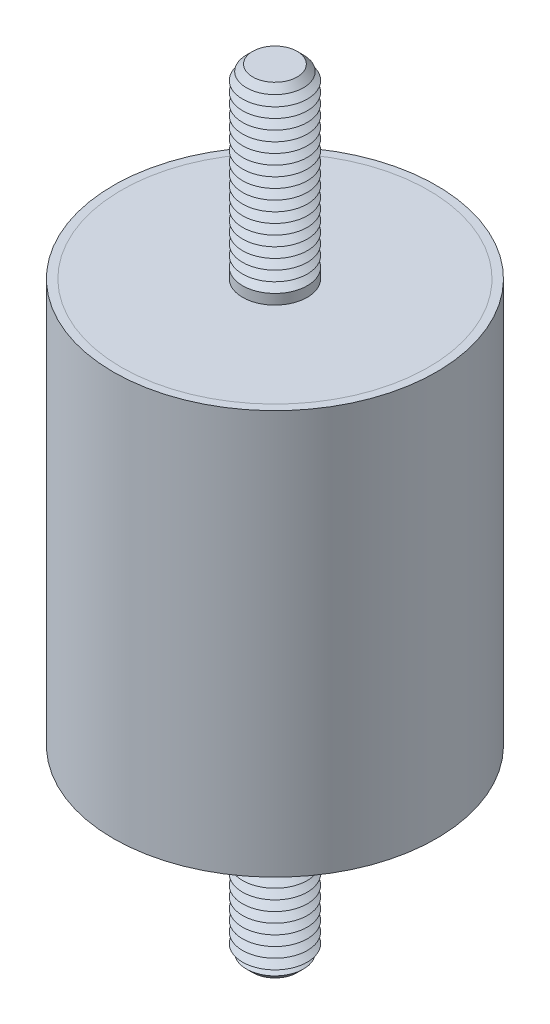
ISO-10303-21;
HEADER;
FILE_DESCRIPTION(('STEP AP214'),'2;1');
FILE_NAME('part.step','',(''),(''),'','','');
FILE_SCHEMA(('AUTOMOTIVE_DESIGN { 1 0 10303 214 1 1 1 1 }'));
ENDSEC;
DATA;
#1=APPLICATION_CONTEXT('core data for automotive mechanical design processes');
#2=APPLICATION_PROTOCOL_DEFINITION('international standard','automotive_design',2000,#1);
#3=PRODUCT_CONTEXT('',#1,'mechanical');
#4=PRODUCT('Part','Part','',(#3));
#5=PRODUCT_RELATED_PRODUCT_CATEGORY('part','',(#4));
#6=PRODUCT_DEFINITION_FORMATION('','',#4);
#7=PRODUCT_DEFINITION_CONTEXT('part definition',#1,'design');
#8=PRODUCT_DEFINITION('design','',#6,#7);
#9=PRODUCT_DEFINITION_SHAPE('','',#8);
#10=(LENGTH_UNIT() NAMED_UNIT(*) SI_UNIT(.MILLI.,.METRE.));
#11=(NAMED_UNIT(*) PLANE_ANGLE_UNIT() SI_UNIT($,.RADIAN.));
#12=(NAMED_UNIT(*) SI_UNIT($,.STERADIAN.) SOLID_ANGLE_UNIT());
#13=UNCERTAINTY_MEASURE_WITH_UNIT(LENGTH_MEASURE(1.E-05),#10,'distance_accuracy_value','');
#14=(GEOMETRIC_REPRESENTATION_CONTEXT(3) GLOBAL_UNCERTAINTY_ASSIGNED_CONTEXT((#13)) GLOBAL_UNIT_ASSIGNED_CONTEXT((#10,
#11,#12)) REPRESENTATION_CONTEXT('',''));
#15=CARTESIAN_POINT('',(0.,0.,0.));
#16=DIRECTION('',(0.,0.,1.));
#17=DIRECTION('',(1.,0.,0.));
#18=AXIS2_PLACEMENT_3D('',#15,#16,#17);
#19=CARTESIAN_POINT('',(0.,-48.,0.));
#20=DIRECTION('',(0.,1.,0.));
#21=DIRECTION('',(0.,0.,1.));
#22=AXIS2_PLACEMENT_3D('',#19,#20,#21);
#23=CYLINDRICAL_SURFACE('',#22,4.);
#24=CARTESIAN_POINT('',(0.,-25.,0.));
#25=DIRECTION('',(0.,-1.,0.));
#26=DIRECTION('',(0.,0.,-1.));
#27=AXIS2_PLACEMENT_3D('',#24,#25,#26);
#28=CIRCLE('',#27,4.);
#29=CARTESIAN_POINT('',(0.,-25.,-4.));
#30=VERTEX_POINT('',#29);
#31=EDGE_CURVE('P0_E22',#30,#30,#28,.T.);
#32=ORIENTED_EDGE('',*,*,#31,.T.);
#33=EDGE_LOOP('',(#32));
#34=FACE_BOUND('',#33,.T.);
#35=CARTESIAN_POINT('',(0.,-26.25,0.));
#36=DIRECTION('',(0.,1.,0.));
#37=DIRECTION('',(0.,0.,1.));
#38=AXIS2_PLACEMENT_3D('',#35,#36,#37);
#39=CIRCLE('',#38,4.);
#40=CARTESIAN_POINT('',(0.,-26.25,4.));
#41=VERTEX_POINT('',#40);
#42=EDGE_CURVE('P0_E32',#41,#41,#39,.T.);
#43=ORIENTED_EDGE('',*,*,#42,.T.);
#44=EDGE_LOOP('',(#43));
#45=FACE_BOUND('',#44,.T.);
#46=ADVANCED_FACE('P0_F14',(#34,#45),#23,.T.);
#47=CARTESIAN_POINT('',(0.,-25.,0.));
#48=DIRECTION('',(0.,1.,0.));
#49=DIRECTION('',(0.,0.,1.));
#50=AXIS2_PLACEMENT_3D('',#47,#48,#49);
#51=CYLINDRICAL_SURFACE('',#50,19.);
#52=CARTESIAN_POINT('',(0.,-25.,0.));
#53=DIRECTION('',(0.,1.,0.));
#54=DIRECTION('',(0.,0.,1.));
#55=AXIS2_PLACEMENT_3D('',#52,#53,#54);
#56=CIRCLE('',#55,19.);
#57=CARTESIAN_POINT('',(0.,-25.,19.));
#58=VERTEX_POINT('',#57);
#59=EDGE_CURVE('P0_E26',#58,#58,#56,.T.);
#60=ORIENTED_EDGE('',*,*,#59,.T.);
#61=EDGE_LOOP('',(#60));
#62=FACE_BOUND('',#61,.T.);
#63=CARTESIAN_POINT('',(0.,-23.,0.));
#64=DIRECTION('',(0.,1.,0.));
#65=DIRECTION('',(0.,0.,1.));
#66=AXIS2_PLACEMENT_3D('',#63,#64,#65);
#67=CIRCLE('',#66,19.);
#68=CARTESIAN_POINT('',(0.,-23.,19.));
#69=VERTEX_POINT('',#68);
#70=EDGE_CURVE('P0_E29',#69,#69,#67,.T.);
#71=ORIENTED_EDGE('',*,*,#70,.F.);
#72=EDGE_LOOP('',(#71));
#73=FACE_BOUND('',#72,.T.);
#74=ADVANCED_FACE('P0_F155',(#62,#73),#51,.T.);
#75=CARTESIAN_POINT('',(0.,-25.,0.));
#76=DIRECTION('',(0.,1.,0.));
#77=DIRECTION('',(0.,0.,1.));
#78=AXIS2_PLACEMENT_3D('',#75,#76,#77);
#79=PLANE('',#78);
#80=ORIENTED_EDGE('',*,*,#31,.F.);
#81=EDGE_LOOP('',(#80));
#82=FACE_BOUND('',#81,.T.);
#83=ORIENTED_EDGE('',*,*,#59,.F.);
#84=EDGE_LOOP('',(#83));
#85=FACE_BOUND('',#84,.T.);
#86=ADVANCED_FACE('P0_F161',(#82,#85),#79,.F.);
#87=CARTESIAN_POINT('',(0.,-23.,0.));
#88=DIRECTION('',(0.,1.,0.));
#89=DIRECTION('',(0.,0.,1.));
#90=AXIS2_PLACEMENT_3D('',#87,#88,#89);
#91=PLANE('',#90);
#92=ORIENTED_EDGE('',*,*,#70,.T.);
#93=EDGE_LOOP('',(#92));
#94=FACE_BOUND('',#93,.T.);
#95=ADVANCED_FACE('P0_F168',(#94),#91,.T.);
#96=CARTESIAN_POINT('',(0.,-26.25,0.));
#97=DIRECTION('',(0.,1.,0.));
#98=DIRECTION('',(0.,0.,1.));
#99=AXIS2_PLACEMENT_3D('',#96,#97,#98);
#100=CONICAL_SURFACE('',#99,4.,1.0471975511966);
#101=CARTESIAN_POINT('',(0.,-26.875,0.));
#102=DIRECTION('',(0.,1.,0.));
#103=DIRECTION('',(0.,0.,1.));
#104=AXIS2_PLACEMENT_3D('',#101,#102,#103);
#105=CIRCLE('',#104,2.91746824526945);
#106=CARTESIAN_POINT('',(0.,-26.875,2.91746824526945));
#107=VERTEX_POINT('',#106);
#108=EDGE_CURVE('P0_E37',#107,#107,#105,.T.);
#109=ORIENTED_EDGE('',*,*,#108,.T.);
#110=EDGE_LOOP('',(#109));
#111=FACE_BOUND('',#110,.T.);
#112=ORIENTED_EDGE('',*,*,#42,.F.);
#113=EDGE_LOOP('',(#112));
#114=FACE_BOUND('',#113,.T.);
#115=ADVANCED_FACE('P0_F171',(#111,#114),#100,.T.);
#116=CARTESIAN_POINT('',(0.,-26.875,0.));
#117=DIRECTION('',(0.,-1.,0.));
#118=DIRECTION('',(0.,0.,-1.));
#119=AXIS2_PLACEMENT_3D('',#116,#117,#118);
#120=CONICAL_SURFACE('',#119,2.91746824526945,1.0471975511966);
#121=CARTESIAN_POINT('',(0.,-27.5,0.));
#122=DIRECTION('',(0.,1.,0.));
#123=DIRECTION('',(0.,0.,1.));
#124=AXIS2_PLACEMENT_3D('',#121,#122,#123);
#125=CIRCLE('',#124,4.);
#126=CARTESIAN_POINT('',(0.,-27.5,4.));
#127=VERTEX_POINT('',#126);
#128=EDGE_CURVE('P0_E40',#127,#127,#125,.T.);
#129=ORIENTED_EDGE('',*,*,#128,.T.);
#130=EDGE_LOOP('',(#129));
#131=FACE_BOUND('',#130,.T.);
#132=ORIENTED_EDGE('',*,*,#108,.F.);
#133=EDGE_LOOP('',(#132));
#134=FACE_BOUND('',#133,.T.);
#135=ADVANCED_FACE('P0_F176',(#131,#134),#120,.T.);
#136=CARTESIAN_POINT('',(0.,-27.5,0.));
#137=DIRECTION('',(0.,1.,0.));
#138=DIRECTION('',(0.,0.,1.));
#139=AXIS2_PLACEMENT_3D('',#136,#137,#138);
#140=CONICAL_SURFACE('',#139,4.,1.0471975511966);
#141=CARTESIAN_POINT('',(0.,-28.125,0.));
#142=DIRECTION('',(0.,1.,0.));
#143=DIRECTION('',(0.,0.,1.));
#144=AXIS2_PLACEMENT_3D('',#141,#142,#143);
#145=CIRCLE('',#144,2.91746824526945);
#146=CARTESIAN_POINT('',(0.,-28.125,2.91746824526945));
#147=VERTEX_POINT('',#146);
#148=EDGE_CURVE('P0_E43',#147,#147,#145,.T.);
#149=ORIENTED_EDGE('',*,*,#148,.T.);
#150=EDGE_LOOP('',(#149));
#151=FACE_BOUND('',#150,.T.);
#152=ORIENTED_EDGE('',*,*,#128,.F.);
#153=EDGE_LOOP('',(#152));
#154=FACE_BOUND('',#153,.T.);
#155=ADVANCED_FACE('P0_F183',(#151,#154),#140,.T.);
#156=CARTESIAN_POINT('',(0.,-28.125,0.));
#157=DIRECTION('',(0.,-1.,0.));
#158=DIRECTION('',(0.,0.,-1.));
#159=AXIS2_PLACEMENT_3D('',#156,#157,#158);
#160=CONICAL_SURFACE('',#159,2.91746824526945,1.0471975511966);
#161=CARTESIAN_POINT('',(0.,-28.75,0.));
#162=DIRECTION('',(0.,1.,0.));
#163=DIRECTION('',(0.,0.,1.));
#164=AXIS2_PLACEMENT_3D('',#161,#162,#163);
#165=CIRCLE('',#164,4.);
#166=CARTESIAN_POINT('',(0.,-28.75,4.));
#167=VERTEX_POINT('',#166);
#168=EDGE_CURVE('P0_E46',#167,#167,#165,.T.);
#169=ORIENTED_EDGE('',*,*,#168,.T.);
#170=EDGE_LOOP('',(#169));
#171=FACE_BOUND('',#170,.T.);
#172=ORIENTED_EDGE('',*,*,#148,.F.);
#173=EDGE_LOOP('',(#172));
#174=FACE_BOUND('',#173,.T.);
#175=ADVANCED_FACE('P0_F190',(#171,#174),#160,.T.);
#176=CARTESIAN_POINT('',(0.,-28.75,0.));
#177=DIRECTION('',(0.,1.,0.));
#178=DIRECTION('',(0.,0.,1.));
#179=AXIS2_PLACEMENT_3D('',#176,#177,#178);
#180=CONICAL_SURFACE('',#179,4.,1.0471975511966);
#181=CARTESIAN_POINT('',(0.,-29.375,0.));
#182=DIRECTION('',(0.,1.,0.));
#183=DIRECTION('',(0.,0.,1.));
#184=AXIS2_PLACEMENT_3D('',#181,#182,#183);
#185=CIRCLE('',#184,2.91746824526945);
#186=CARTESIAN_POINT('',(0.,-29.375,2.91746824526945));
#187=VERTEX_POINT('',#186);
#188=EDGE_CURVE('P0_E49',#187,#187,#185,.T.);
#189=ORIENTED_EDGE('',*,*,#188,.T.);
#190=EDGE_LOOP('',(#189));
#191=FACE_BOUND('',#190,.T.);
#192=ORIENTED_EDGE('',*,*,#168,.F.);
#193=EDGE_LOOP('',(#192));
#194=FACE_BOUND('',#193,.T.);
#195=ADVANCED_FACE('P0_F194',(#191,#194),#180,.T.);
#196=CARTESIAN_POINT('',(0.,-29.375,0.));
#197=DIRECTION('',(0.,-1.,0.));
#198=DIRECTION('',(0.,0.,-1.));
#199=AXIS2_PLACEMENT_3D('',#196,#197,#198);
#200=CONICAL_SURFACE('',#199,2.91746824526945,1.0471975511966);
#201=CARTESIAN_POINT('',(0.,-30.,0.));
#202=DIRECTION('',(0.,1.,0.));
#203=DIRECTION('',(0.,0.,1.));
#204=AXIS2_PLACEMENT_3D('',#201,#202,#203);
#205=CIRCLE('',#204,4.);
#206=CARTESIAN_POINT('',(0.,-30.,4.));
#207=VERTEX_POINT('',#206);
#208=EDGE_CURVE('P0_E52',#207,#207,#205,.T.);
#209=ORIENTED_EDGE('',*,*,#208,.T.);
#210=EDGE_LOOP('',(#209));
#211=FACE_BOUND('',#210,.T.);
#212=ORIENTED_EDGE('',*,*,#188,.F.);
#213=EDGE_LOOP('',(#212));
#214=FACE_BOUND('',#213,.T.);
#215=ADVANCED_FACE('P0_F198',(#211,#214),#200,.T.);
#216=CARTESIAN_POINT('',(0.,-30.,0.));
#217=DIRECTION('',(0.,1.,0.));
#218=DIRECTION('',(0.,0.,1.));
#219=AXIS2_PLACEMENT_3D('',#216,#217,#218);
#220=CONICAL_SURFACE('',#219,4.,1.0471975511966);
#221=CARTESIAN_POINT('',(0.,-30.625,0.));
#222=DIRECTION('',(0.,1.,0.));
#223=DIRECTION('',(0.,0.,1.));
#224=AXIS2_PLACEMENT_3D('',#221,#222,#223);
#225=CIRCLE('',#224,2.91746824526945);
#226=CARTESIAN_POINT('',(0.,-30.625,2.91746824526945));
#227=VERTEX_POINT('',#226);
#228=EDGE_CURVE('P0_E55',#227,#227,#225,.T.);
#229=ORIENTED_EDGE('',*,*,#228,.T.);
#230=EDGE_LOOP('',(#229));
#231=FACE_BOUND('',#230,.T.);
#232=ORIENTED_EDGE('',*,*,#208,.F.);
#233=EDGE_LOOP('',(#232));
#234=FACE_BOUND('',#233,.T.);
#235=ADVANCED_FACE('P0_F202',(#231,#234),#220,.T.);
#236=CARTESIAN_POINT('',(0.,-30.625,0.));
#237=DIRECTION('',(0.,-1.,0.));
#238=DIRECTION('',(0.,0.,-1.));
#239=AXIS2_PLACEMENT_3D('',#236,#237,#238);
#240=CONICAL_SURFACE('',#239,2.91746824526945,1.0471975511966);
#241=CARTESIAN_POINT('',(0.,-31.25,0.));
#242=DIRECTION('',(0.,1.,0.));
#243=DIRECTION('',(0.,0.,1.));
#244=AXIS2_PLACEMENT_3D('',#241,#242,#243);
#245=CIRCLE('',#244,4.);
#246=CARTESIAN_POINT('',(0.,-31.25,4.));
#247=VERTEX_POINT('',#246);
#248=EDGE_CURVE('P0_E58',#247,#247,#245,.T.);
#249=ORIENTED_EDGE('',*,*,#248,.T.);
#250=EDGE_LOOP('',(#249));
#251=FACE_BOUND('',#250,.T.);
#252=ORIENTED_EDGE('',*,*,#228,.F.);
#253=EDGE_LOOP('',(#252));
#254=FACE_BOUND('',#253,.T.);
#255=ADVANCED_FACE('P0_F206',(#251,#254),#240,.T.);
#256=CARTESIAN_POINT('',(0.,-31.25,0.));
#257=DIRECTION('',(0.,1.,0.));
#258=DIRECTION('',(0.,0.,1.));
#259=AXIS2_PLACEMENT_3D('',#256,#257,#258);
#260=CONICAL_SURFACE('',#259,4.,1.0471975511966);
#261=CARTESIAN_POINT('',(0.,-31.875,0.));
#262=DIRECTION('',(0.,1.,0.));
#263=DIRECTION('',(0.,0.,1.));
#264=AXIS2_PLACEMENT_3D('',#261,#262,#263);
#265=CIRCLE('',#264,2.91746824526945);
#266=CARTESIAN_POINT('',(0.,-31.875,2.91746824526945));
#267=VERTEX_POINT('',#266);
#268=EDGE_CURVE('P0_E61',#267,#267,#265,.T.);
#269=ORIENTED_EDGE('',*,*,#268,.T.);
#270=EDGE_LOOP('',(#269));
#271=FACE_BOUND('',#270,.T.);
#272=ORIENTED_EDGE('',*,*,#248,.F.);
#273=EDGE_LOOP('',(#272));
#274=FACE_BOUND('',#273,.T.);
#275=ADVANCED_FACE('P0_F210',(#271,#274),#260,.T.);
#276=CARTESIAN_POINT('',(0.,-31.875,0.));
#277=DIRECTION('',(0.,-1.,0.));
#278=DIRECTION('',(0.,0.,-1.));
#279=AXIS2_PLACEMENT_3D('',#276,#277,#278);
#280=CONICAL_SURFACE('',#279,2.91746824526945,1.0471975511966);
#281=CARTESIAN_POINT('',(0.,-32.5,0.));
#282=DIRECTION('',(0.,1.,0.));
#283=DIRECTION('',(0.,0.,1.));
#284=AXIS2_PLACEMENT_3D('',#281,#282,#283);
#285=CIRCLE('',#284,4.);
#286=CARTESIAN_POINT('',(0.,-32.5,4.));
#287=VERTEX_POINT('',#286);
#288=EDGE_CURVE('P0_E64',#287,#287,#285,.T.);
#289=ORIENTED_EDGE('',*,*,#288,.T.);
#290=EDGE_LOOP('',(#289));
#291=FACE_BOUND('',#290,.T.);
#292=ORIENTED_EDGE('',*,*,#268,.F.);
#293=EDGE_LOOP('',(#292));
#294=FACE_BOUND('',#293,.T.);
#295=ADVANCED_FACE('P0_F214',(#291,#294),#280,.T.);
#296=CARTESIAN_POINT('',(0.,-32.5,0.));
#297=DIRECTION('',(0.,1.,0.));
#298=DIRECTION('',(0.,0.,1.));
#299=AXIS2_PLACEMENT_3D('',#296,#297,#298);
#300=CONICAL_SURFACE('',#299,4.,1.0471975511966);
#301=CARTESIAN_POINT('',(0.,-33.125,0.));
#302=DIRECTION('',(0.,1.,0.));
#303=DIRECTION('',(0.,0.,1.));
#304=AXIS2_PLACEMENT_3D('',#301,#302,#303);
#305=CIRCLE('',#304,2.91746824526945);
#306=CARTESIAN_POINT('',(0.,-33.125,2.91746824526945));
#307=VERTEX_POINT('',#306);
#308=EDGE_CURVE('P0_E67',#307,#307,#305,.T.);
#309=ORIENTED_EDGE('',*,*,#308,.T.);
#310=EDGE_LOOP('',(#309));
#311=FACE_BOUND('',#310,.T.);
#312=ORIENTED_EDGE('',*,*,#288,.F.);
#313=EDGE_LOOP('',(#312));
#314=FACE_BOUND('',#313,.T.);
#315=ADVANCED_FACE('P0_F218',(#311,#314),#300,.T.);
#316=CARTESIAN_POINT('',(0.,-33.125,0.));
#317=DIRECTION('',(0.,-1.,0.));
#318=DIRECTION('',(0.,0.,-1.));
#319=AXIS2_PLACEMENT_3D('',#316,#317,#318);
#320=CONICAL_SURFACE('',#319,2.91746824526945,1.0471975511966);
#321=CARTESIAN_POINT('',(0.,-33.75,0.));
#322=DIRECTION('',(0.,1.,0.));
#323=DIRECTION('',(0.,0.,1.));
#324=AXIS2_PLACEMENT_3D('',#321,#322,#323);
#325=CIRCLE('',#324,4.);
#326=CARTESIAN_POINT('',(0.,-33.75,4.));
#327=VERTEX_POINT('',#326);
#328=EDGE_CURVE('P0_E70',#327,#327,#325,.T.);
#329=ORIENTED_EDGE('',*,*,#328,.T.);
#330=EDGE_LOOP('',(#329));
#331=FACE_BOUND('',#330,.T.);
#332=ORIENTED_EDGE('',*,*,#308,.F.);
#333=EDGE_LOOP('',(#332));
#334=FACE_BOUND('',#333,.T.);
#335=ADVANCED_FACE('P0_F222',(#331,#334),#320,.T.);
#336=CARTESIAN_POINT('',(0.,-33.75,0.));
#337=DIRECTION('',(0.,1.,0.));
#338=DIRECTION('',(0.,0.,1.));
#339=AXIS2_PLACEMENT_3D('',#336,#337,#338);
#340=CONICAL_SURFACE('',#339,4.,1.0471975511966);
#341=CARTESIAN_POINT('',(0.,-34.375,0.));
#342=DIRECTION('',(0.,1.,0.));
#343=DIRECTION('',(0.,0.,1.));
#344=AXIS2_PLACEMENT_3D('',#341,#342,#343);
#345=CIRCLE('',#344,2.91746824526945);
#346=CARTESIAN_POINT('',(0.,-34.375,2.91746824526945));
#347=VERTEX_POINT('',#346);
#348=EDGE_CURVE('P0_E73',#347,#347,#345,.T.);
#349=ORIENTED_EDGE('',*,*,#348,.T.);
#350=EDGE_LOOP('',(#349));
#351=FACE_BOUND('',#350,.T.);
#352=ORIENTED_EDGE('',*,*,#328,.F.);
#353=EDGE_LOOP('',(#352));
#354=FACE_BOUND('',#353,.T.);
#355=ADVANCED_FACE('P0_F226',(#351,#354),#340,.T.);
#356=CARTESIAN_POINT('',(0.,-34.375,0.));
#357=DIRECTION('',(0.,-1.,0.));
#358=DIRECTION('',(0.,0.,-1.));
#359=AXIS2_PLACEMENT_3D('',#356,#357,#358);
#360=CONICAL_SURFACE('',#359,2.91746824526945,1.0471975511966);
#361=CARTESIAN_POINT('',(0.,-35.,0.));
#362=DIRECTION('',(0.,1.,0.));
#363=DIRECTION('',(0.,0.,1.));
#364=AXIS2_PLACEMENT_3D('',#361,#362,#363);
#365=CIRCLE('',#364,4.);
#366=CARTESIAN_POINT('',(0.,-35.,4.));
#367=VERTEX_POINT('',#366);
#368=EDGE_CURVE('P0_E76',#367,#367,#365,.T.);
#369=ORIENTED_EDGE('',*,*,#368,.T.);
#370=EDGE_LOOP('',(#369));
#371=FACE_BOUND('',#370,.T.);
#372=ORIENTED_EDGE('',*,*,#348,.F.);
#373=EDGE_LOOP('',(#372));
#374=FACE_BOUND('',#373,.T.);
#375=ADVANCED_FACE('P0_F230',(#371,#374),#360,.T.);
#376=CARTESIAN_POINT('',(0.,-35.,0.));
#377=DIRECTION('',(0.,1.,0.));
#378=DIRECTION('',(0.,0.,1.));
#379=AXIS2_PLACEMENT_3D('',#376,#377,#378);
#380=CONICAL_SURFACE('',#379,4.,1.0471975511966);
#381=CARTESIAN_POINT('',(0.,-35.625,0.));
#382=DIRECTION('',(0.,1.,0.));
#383=DIRECTION('',(0.,0.,1.));
#384=AXIS2_PLACEMENT_3D('',#381,#382,#383);
#385=CIRCLE('',#384,2.91746824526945);
#386=CARTESIAN_POINT('',(0.,-35.625,2.91746824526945));
#387=VERTEX_POINT('',#386);
#388=EDGE_CURVE('P0_E79',#387,#387,#385,.T.);
#389=ORIENTED_EDGE('',*,*,#388,.T.);
#390=EDGE_LOOP('',(#389));
#391=FACE_BOUND('',#390,.T.);
#392=ORIENTED_EDGE('',*,*,#368,.F.);
#393=EDGE_LOOP('',(#392));
#394=FACE_BOUND('',#393,.T.);
#395=ADVANCED_FACE('P0_F234',(#391,#394),#380,.T.);
#396=CARTESIAN_POINT('',(0.,-35.625,0.));
#397=DIRECTION('',(0.,-1.,0.));
#398=DIRECTION('',(0.,0.,-1.));
#399=AXIS2_PLACEMENT_3D('',#396,#397,#398);
#400=CONICAL_SURFACE('',#399,2.91746824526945,1.0471975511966);
#401=CARTESIAN_POINT('',(0.,-36.25,0.));
#402=DIRECTION('',(0.,1.,0.));
#403=DIRECTION('',(0.,0.,1.));
#404=AXIS2_PLACEMENT_3D('',#401,#402,#403);
#405=CIRCLE('',#404,4.);
#406=CARTESIAN_POINT('',(0.,-36.25,4.));
#407=VERTEX_POINT('',#406);
#408=EDGE_CURVE('P0_E82',#407,#407,#405,.T.);
#409=ORIENTED_EDGE('',*,*,#408,.T.);
#410=EDGE_LOOP('',(#409));
#411=FACE_BOUND('',#410,.T.);
#412=ORIENTED_EDGE('',*,*,#388,.F.);
#413=EDGE_LOOP('',(#412));
#414=FACE_BOUND('',#413,.T.);
#415=ADVANCED_FACE('P0_F238',(#411,#414),#400,.T.);
#416=CARTESIAN_POINT('',(0.,-36.25,0.));
#417=DIRECTION('',(0.,1.,0.));
#418=DIRECTION('',(0.,0.,1.));
#419=AXIS2_PLACEMENT_3D('',#416,#417,#418);
#420=CONICAL_SURFACE('',#419,4.,1.0471975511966);
#421=CARTESIAN_POINT('',(0.,-36.875,0.));
#422=DIRECTION('',(0.,1.,0.));
#423=DIRECTION('',(0.,0.,1.));
#424=AXIS2_PLACEMENT_3D('',#421,#422,#423);
#425=CIRCLE('',#424,2.91746824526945);
#426=CARTESIAN_POINT('',(0.,-36.875,2.91746824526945));
#427=VERTEX_POINT('',#426);
#428=EDGE_CURVE('P0_E85',#427,#427,#425,.T.);
#429=ORIENTED_EDGE('',*,*,#428,.T.);
#430=EDGE_LOOP('',(#429));
#431=FACE_BOUND('',#430,.T.);
#432=ORIENTED_EDGE('',*,*,#408,.F.);
#433=EDGE_LOOP('',(#432));
#434=FACE_BOUND('',#433,.T.);
#435=ADVANCED_FACE('P0_F242',(#431,#434),#420,.T.);
#436=CARTESIAN_POINT('',(0.,-36.875,0.));
#437=DIRECTION('',(0.,-1.,0.));
#438=DIRECTION('',(0.,0.,-1.));
#439=AXIS2_PLACEMENT_3D('',#436,#437,#438);
#440=CONICAL_SURFACE('',#439,2.91746824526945,1.0471975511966);
#441=CARTESIAN_POINT('',(0.,-37.5,0.));
#442=DIRECTION('',(0.,1.,0.));
#443=DIRECTION('',(0.,0.,1.));
#444=AXIS2_PLACEMENT_3D('',#441,#442,#443);
#445=CIRCLE('',#444,4.);
#446=CARTESIAN_POINT('',(0.,-37.5,4.));
#447=VERTEX_POINT('',#446);
#448=EDGE_CURVE('P0_E88',#447,#447,#445,.T.);
#449=ORIENTED_EDGE('',*,*,#448,.T.);
#450=EDGE_LOOP('',(#449));
#451=FACE_BOUND('',#450,.T.);
#452=ORIENTED_EDGE('',*,*,#428,.F.);
#453=EDGE_LOOP('',(#452));
#454=FACE_BOUND('',#453,.T.);
#455=ADVANCED_FACE('P0_F246',(#451,#454),#440,.T.);
#456=CARTESIAN_POINT('',(0.,-37.5,0.));
#457=DIRECTION('',(0.,1.,0.));
#458=DIRECTION('',(0.,0.,1.));
#459=AXIS2_PLACEMENT_3D('',#456,#457,#458);
#460=CONICAL_SURFACE('',#459,4.,1.0471975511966);
#461=CARTESIAN_POINT('',(0.,-38.125,0.));
#462=DIRECTION('',(0.,1.,0.));
#463=DIRECTION('',(0.,0.,1.));
#464=AXIS2_PLACEMENT_3D('',#461,#462,#463);
#465=CIRCLE('',#464,2.91746824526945);
#466=CARTESIAN_POINT('',(0.,-38.125,2.91746824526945));
#467=VERTEX_POINT('',#466);
#468=EDGE_CURVE('P0_E91',#467,#467,#465,.T.);
#469=ORIENTED_EDGE('',*,*,#468,.T.);
#470=EDGE_LOOP('',(#469));
#471=FACE_BOUND('',#470,.T.);
#472=ORIENTED_EDGE('',*,*,#448,.F.);
#473=EDGE_LOOP('',(#472));
#474=FACE_BOUND('',#473,.T.);
#475=ADVANCED_FACE('P0_F250',(#471,#474),#460,.T.);
#476=CARTESIAN_POINT('',(0.,-38.125,0.));
#477=DIRECTION('',(0.,-1.,0.));
#478=DIRECTION('',(0.,0.,-1.));
#479=AXIS2_PLACEMENT_3D('',#476,#477,#478);
#480=CONICAL_SURFACE('',#479,2.91746824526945,1.0471975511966);
#481=CARTESIAN_POINT('',(0.,-38.75,0.));
#482=DIRECTION('',(0.,1.,0.));
#483=DIRECTION('',(0.,0.,1.));
#484=AXIS2_PLACEMENT_3D('',#481,#482,#483);
#485=CIRCLE('',#484,4.);
#486=CARTESIAN_POINT('',(0.,-38.75,4.));
#487=VERTEX_POINT('',#486);
#488=EDGE_CURVE('P0_E94',#487,#487,#485,.T.);
#489=ORIENTED_EDGE('',*,*,#488,.T.);
#490=EDGE_LOOP('',(#489));
#491=FACE_BOUND('',#490,.T.);
#492=ORIENTED_EDGE('',*,*,#468,.F.);
#493=EDGE_LOOP('',(#492));
#494=FACE_BOUND('',#493,.T.);
#495=ADVANCED_FACE('P0_F254',(#491,#494),#480,.T.);
#496=CARTESIAN_POINT('',(0.,-38.75,0.));
#497=DIRECTION('',(0.,1.,0.));
#498=DIRECTION('',(0.,0.,1.));
#499=AXIS2_PLACEMENT_3D('',#496,#497,#498);
#500=CONICAL_SURFACE('',#499,4.,1.0471975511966);
#501=CARTESIAN_POINT('',(0.,-39.375,0.));
#502=DIRECTION('',(0.,1.,0.));
#503=DIRECTION('',(0.,0.,1.));
#504=AXIS2_PLACEMENT_3D('',#501,#502,#503);
#505=CIRCLE('',#504,2.91746824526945);
#506=CARTESIAN_POINT('',(0.,-39.375,2.91746824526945));
#507=VERTEX_POINT('',#506);
#508=EDGE_CURVE('P0_E97',#507,#507,#505,.T.);
#509=ORIENTED_EDGE('',*,*,#508,.T.);
#510=EDGE_LOOP('',(#509));
#511=FACE_BOUND('',#510,.T.);
#512=ORIENTED_EDGE('',*,*,#488,.F.);
#513=EDGE_LOOP('',(#512));
#514=FACE_BOUND('',#513,.T.);
#515=ADVANCED_FACE('P0_F258',(#511,#514),#500,.T.);
#516=CARTESIAN_POINT('',(0.,-39.375,0.));
#517=DIRECTION('',(0.,-1.,0.));
#518=DIRECTION('',(0.,0.,-1.));
#519=AXIS2_PLACEMENT_3D('',#516,#517,#518);
#520=CONICAL_SURFACE('',#519,2.91746824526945,1.0471975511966);
#521=CARTESIAN_POINT('',(0.,-40.,0.));
#522=DIRECTION('',(0.,1.,0.));
#523=DIRECTION('',(0.,0.,1.));
#524=AXIS2_PLACEMENT_3D('',#521,#522,#523);
#525=CIRCLE('',#524,4.);
#526=CARTESIAN_POINT('',(0.,-40.,4.));
#527=VERTEX_POINT('',#526);
#528=EDGE_CURVE('P0_E100',#527,#527,#525,.T.);
#529=ORIENTED_EDGE('',*,*,#528,.T.);
#530=EDGE_LOOP('',(#529));
#531=FACE_BOUND('',#530,.T.);
#532=ORIENTED_EDGE('',*,*,#508,.F.);
#533=EDGE_LOOP('',(#532));
#534=FACE_BOUND('',#533,.T.);
#535=ADVANCED_FACE('P0_F262',(#531,#534),#520,.T.);
#536=CARTESIAN_POINT('',(0.,-40.,0.));
#537=DIRECTION('',(0.,1.,0.));
#538=DIRECTION('',(0.,0.,1.));
#539=AXIS2_PLACEMENT_3D('',#536,#537,#538);
#540=CONICAL_SURFACE('',#539,4.,1.0471975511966);
#541=CARTESIAN_POINT('',(0.,-40.625,0.));
#542=DIRECTION('',(0.,1.,0.));
#543=DIRECTION('',(0.,0.,1.));
#544=AXIS2_PLACEMENT_3D('',#541,#542,#543);
#545=CIRCLE('',#544,2.91746824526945);
#546=CARTESIAN_POINT('',(0.,-40.625,2.91746824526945));
#547=VERTEX_POINT('',#546);
#548=EDGE_CURVE('P0_E103',#547,#547,#545,.T.);
#549=ORIENTED_EDGE('',*,*,#548,.T.);
#550=EDGE_LOOP('',(#549));
#551=FACE_BOUND('',#550,.T.);
#552=ORIENTED_EDGE('',*,*,#528,.F.);
#553=EDGE_LOOP('',(#552));
#554=FACE_BOUND('',#553,.T.);
#555=ADVANCED_FACE('P0_F266',(#551,#554),#540,.T.);
#556=CARTESIAN_POINT('',(0.,-40.625,0.));
#557=DIRECTION('',(0.,-1.,0.));
#558=DIRECTION('',(0.,0.,-1.));
#559=AXIS2_PLACEMENT_3D('',#556,#557,#558);
#560=CONICAL_SURFACE('',#559,2.91746824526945,1.0471975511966);
#561=CARTESIAN_POINT('',(0.,-41.25,0.));
#562=DIRECTION('',(0.,1.,0.));
#563=DIRECTION('',(0.,0.,1.));
#564=AXIS2_PLACEMENT_3D('',#561,#562,#563);
#565=CIRCLE('',#564,4.);
#566=CARTESIAN_POINT('',(0.,-41.25,4.));
#567=VERTEX_POINT('',#566);
#568=EDGE_CURVE('P0_E106',#567,#567,#565,.T.);
#569=ORIENTED_EDGE('',*,*,#568,.T.);
#570=EDGE_LOOP('',(#569));
#571=FACE_BOUND('',#570,.T.);
#572=ORIENTED_EDGE('',*,*,#548,.F.);
#573=EDGE_LOOP('',(#572));
#574=FACE_BOUND('',#573,.T.);
#575=ADVANCED_FACE('P0_F270',(#571,#574),#560,.T.);
#576=CARTESIAN_POINT('',(0.,-41.25,0.));
#577=DIRECTION('',(0.,1.,0.));
#578=DIRECTION('',(0.,0.,1.));
#579=AXIS2_PLACEMENT_3D('',#576,#577,#578);
#580=CONICAL_SURFACE('',#579,4.,1.0471975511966);
#581=CARTESIAN_POINT('',(0.,-41.875,0.));
#582=DIRECTION('',(0.,1.,0.));
#583=DIRECTION('',(0.,0.,1.));
#584=AXIS2_PLACEMENT_3D('',#581,#582,#583);
#585=CIRCLE('',#584,2.91746824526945);
#586=CARTESIAN_POINT('',(0.,-41.875,2.91746824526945));
#587=VERTEX_POINT('',#586);
#588=EDGE_CURVE('P0_E109',#587,#587,#585,.T.);
#589=ORIENTED_EDGE('',*,*,#588,.T.);
#590=EDGE_LOOP('',(#589));
#591=FACE_BOUND('',#590,.T.);
#592=ORIENTED_EDGE('',*,*,#568,.F.);
#593=EDGE_LOOP('',(#592));
#594=FACE_BOUND('',#593,.T.);
#595=ADVANCED_FACE('P0_F274',(#591,#594),#580,.T.);
#596=CARTESIAN_POINT('',(0.,-41.875,0.));
#597=DIRECTION('',(0.,-1.,0.));
#598=DIRECTION('',(0.,0.,-1.));
#599=AXIS2_PLACEMENT_3D('',#596,#597,#598);
#600=CONICAL_SURFACE('',#599,2.91746824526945,1.0471975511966);
#601=CARTESIAN_POINT('',(0.,-42.5,0.));
#602=DIRECTION('',(0.,1.,0.));
#603=DIRECTION('',(0.,0.,1.));
#604=AXIS2_PLACEMENT_3D('',#601,#602,#603);
#605=CIRCLE('',#604,4.);
#606=CARTESIAN_POINT('',(0.,-42.5,4.));
#607=VERTEX_POINT('',#606);
#608=EDGE_CURVE('P0_E112',#607,#607,#605,.T.);
#609=ORIENTED_EDGE('',*,*,#608,.T.);
#610=EDGE_LOOP('',(#609));
#611=FACE_BOUND('',#610,.T.);
#612=ORIENTED_EDGE('',*,*,#588,.F.);
#613=EDGE_LOOP('',(#612));
#614=FACE_BOUND('',#613,.T.);
#615=ADVANCED_FACE('P0_F278',(#611,#614),#600,.T.);
#616=CARTESIAN_POINT('',(0.,-42.5,0.));
#617=DIRECTION('',(0.,1.,0.));
#618=DIRECTION('',(0.,0.,1.));
#619=AXIS2_PLACEMENT_3D('',#616,#617,#618);
#620=CONICAL_SURFACE('',#619,4.,1.0471975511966);
#621=CARTESIAN_POINT('',(0.,-43.125,0.));
#622=DIRECTION('',(0.,1.,0.));
#623=DIRECTION('',(0.,0.,1.));
#624=AXIS2_PLACEMENT_3D('',#621,#622,#623);
#625=CIRCLE('',#624,2.91746824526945);
#626=CARTESIAN_POINT('',(0.,-43.125,2.91746824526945));
#627=VERTEX_POINT('',#626);
#628=EDGE_CURVE('P0_E115',#627,#627,#625,.T.);
#629=ORIENTED_EDGE('',*,*,#628,.T.);
#630=EDGE_LOOP('',(#629));
#631=FACE_BOUND('',#630,.T.);
#632=ORIENTED_EDGE('',*,*,#608,.F.);
#633=EDGE_LOOP('',(#632));
#634=FACE_BOUND('',#633,.T.);
#635=ADVANCED_FACE('P0_F282',(#631,#634),#620,.T.);
#636=CARTESIAN_POINT('',(0.,-43.125,0.));
#637=DIRECTION('',(0.,-1.,0.));
#638=DIRECTION('',(0.,0.,-1.));
#639=AXIS2_PLACEMENT_3D('',#636,#637,#638);
#640=CONICAL_SURFACE('',#639,2.91746824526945,1.0471975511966);
#641=CARTESIAN_POINT('',(0.,-43.75,0.));
#642=DIRECTION('',(0.,1.,0.));
#643=DIRECTION('',(0.,0.,1.));
#644=AXIS2_PLACEMENT_3D('',#641,#642,#643);
#645=CIRCLE('',#644,4.);
#646=CARTESIAN_POINT('',(0.,-43.75,4.));
#647=VERTEX_POINT('',#646);
#648=EDGE_CURVE('P0_E118',#647,#647,#645,.T.);
#649=ORIENTED_EDGE('',*,*,#648,.T.);
#650=EDGE_LOOP('',(#649));
#651=FACE_BOUND('',#650,.T.);
#652=ORIENTED_EDGE('',*,*,#628,.F.);
#653=EDGE_LOOP('',(#652));
#654=FACE_BOUND('',#653,.T.);
#655=ADVANCED_FACE('P0_F286',(#651,#654),#640,.T.);
#656=CARTESIAN_POINT('',(0.,-43.75,0.));
#657=DIRECTION('',(0.,1.,0.));
#658=DIRECTION('',(0.,0.,1.));
#659=AXIS2_PLACEMENT_3D('',#656,#657,#658);
#660=CONICAL_SURFACE('',#659,4.,1.0471975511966);
#661=CARTESIAN_POINT('',(0.,-44.375,0.));
#662=DIRECTION('',(0.,1.,0.));
#663=DIRECTION('',(0.,0.,1.));
#664=AXIS2_PLACEMENT_3D('',#661,#662,#663);
#665=CIRCLE('',#664,2.91746824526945);
#666=CARTESIAN_POINT('',(0.,-44.375,2.91746824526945));
#667=VERTEX_POINT('',#666);
#668=EDGE_CURVE('P0_E121',#667,#667,#665,.T.);
#669=ORIENTED_EDGE('',*,*,#668,.T.);
#670=EDGE_LOOP('',(#669));
#671=FACE_BOUND('',#670,.T.);
#672=ORIENTED_EDGE('',*,*,#648,.F.);
#673=EDGE_LOOP('',(#672));
#674=FACE_BOUND('',#673,.T.);
#675=ADVANCED_FACE('P0_F290',(#671,#674),#660,.T.);
#676=CARTESIAN_POINT('',(0.,-44.375,0.));
#677=DIRECTION('',(0.,-1.,0.));
#678=DIRECTION('',(0.,0.,-1.));
#679=AXIS2_PLACEMENT_3D('',#676,#677,#678);
#680=CONICAL_SURFACE('',#679,2.91746824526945,1.0471975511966);
#681=CARTESIAN_POINT('',(0.,-45.,0.));
#682=DIRECTION('',(0.,1.,0.));
#683=DIRECTION('',(0.,0.,1.));
#684=AXIS2_PLACEMENT_3D('',#681,#682,#683);
#685=CIRCLE('',#684,4.);
#686=CARTESIAN_POINT('',(0.,-45.,4.));
#687=VERTEX_POINT('',#686);
#688=EDGE_CURVE('P0_E124',#687,#687,#685,.T.);
#689=ORIENTED_EDGE('',*,*,#688,.T.);
#690=EDGE_LOOP('',(#689));
#691=FACE_BOUND('',#690,.T.);
#692=ORIENTED_EDGE('',*,*,#668,.F.);
#693=EDGE_LOOP('',(#692));
#694=FACE_BOUND('',#693,.T.);
#695=ADVANCED_FACE('P0_F294',(#691,#694),#680,.T.);
#696=CARTESIAN_POINT('',(0.,-45.,0.));
#697=DIRECTION('',(0.,1.,0.));
#698=DIRECTION('',(0.,0.,1.));
#699=AXIS2_PLACEMENT_3D('',#696,#697,#698);
#700=CONICAL_SURFACE('',#699,4.,1.0471975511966);
#701=CARTESIAN_POINT('',(0.,-45.625,0.));
#702=DIRECTION('',(0.,1.,0.));
#703=DIRECTION('',(0.,0.,1.));
#704=AXIS2_PLACEMENT_3D('',#701,#702,#703);
#705=CIRCLE('',#704,2.91746824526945);
#706=CARTESIAN_POINT('',(0.,-45.625,2.91746824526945));
#707=VERTEX_POINT('',#706);
#708=EDGE_CURVE('P0_E127',#707,#707,#705,.T.);
#709=ORIENTED_EDGE('',*,*,#708,.T.);
#710=EDGE_LOOP('',(#709));
#711=FACE_BOUND('',#710,.T.);
#712=ORIENTED_EDGE('',*,*,#688,.F.);
#713=EDGE_LOOP('',(#712));
#714=FACE_BOUND('',#713,.T.);
#715=ADVANCED_FACE('P0_F298',(#711,#714),#700,.T.);
#716=CARTESIAN_POINT('',(0.,-45.625,0.));
#717=DIRECTION('',(0.,-1.,0.));
#718=DIRECTION('',(0.,0.,-1.));
#719=AXIS2_PLACEMENT_3D('',#716,#717,#718);
#720=CONICAL_SURFACE('',#719,2.91746824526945,1.0471975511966);
#721=CARTESIAN_POINT('',(0.,-46.25,0.));
#722=DIRECTION('',(0.,1.,0.));
#723=DIRECTION('',(0.,0.,1.));
#724=AXIS2_PLACEMENT_3D('',#721,#722,#723);
#725=CIRCLE('',#724,4.);
#726=CARTESIAN_POINT('',(0.,-46.25,4.));
#727=VERTEX_POINT('',#726);
#728=EDGE_CURVE('P0_E130',#727,#727,#725,.T.);
#729=ORIENTED_EDGE('',*,*,#728,.T.);
#730=EDGE_LOOP('',(#729));
#731=FACE_BOUND('',#730,.T.);
#732=ORIENTED_EDGE('',*,*,#708,.F.);
#733=EDGE_LOOP('',(#732));
#734=FACE_BOUND('',#733,.T.);
#735=ADVANCED_FACE('P0_F151',(#731,#734),#720,.T.);
#736=CARTESIAN_POINT('',(0.,-46.25,0.));
#737=DIRECTION('',(0.,1.,0.));
#738=DIRECTION('',(0.,0.,1.));
#739=AXIS2_PLACEMENT_3D('',#736,#737,#738);
#740=CONICAL_SURFACE('',#739,4.,1.0471975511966);
#741=CARTESIAN_POINT('',(0.,-46.875,0.));
#742=DIRECTION('',(0.,1.,0.));
#743=DIRECTION('',(0.,0.,1.));
#744=AXIS2_PLACEMENT_3D('',#741,#742,#743);
#745=CIRCLE('',#744,2.91746824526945);
#746=CARTESIAN_POINT('',(0.,-46.875,2.91746824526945));
#747=VERTEX_POINT('',#746);
#748=EDGE_CURVE('P0_E133',#747,#747,#745,.T.);
#749=ORIENTED_EDGE('',*,*,#748,.T.);
#750=EDGE_LOOP('',(#749));
#751=FACE_BOUND('',#750,.T.);
#752=ORIENTED_EDGE('',*,*,#728,.F.);
#753=EDGE_LOOP('',(#752));
#754=FACE_BOUND('',#753,.T.);
#755=ADVANCED_FACE('P0_F137',(#751,#754),#740,.T.);
#756=CARTESIAN_POINT('',(0.,-46.875,0.));
#757=DIRECTION('',(0.,-1.,0.));
#758=DIRECTION('',(0.,0.,-1.));
#759=AXIS2_PLACEMENT_3D('',#756,#757,#758);
#760=CONICAL_SURFACE('',#759,2.91746824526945,1.0471975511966);
#761=CARTESIAN_POINT('',(0.,-47.2254809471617,0.));
#762=DIRECTION('',(0.,-1.,0.));
#763=DIRECTION('',(0.,0.,-1.));
#764=AXIS2_PLACEMENT_3D('',#761,#762,#763);
#765=CIRCLE('',#764,3.52451905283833);
#766=CARTESIAN_POINT('',(0.,-47.2254809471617,-3.52451905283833));
#767=VERTEX_POINT('',#766);
#768=EDGE_CURVE('P0_E18',#767,#767,#765,.T.);
#769=ORIENTED_EDGE('',*,*,#768,.F.);
#770=EDGE_LOOP('',(#769));
#771=FACE_BOUND('',#770,.T.);
#772=ORIENTED_EDGE('',*,*,#748,.F.);
#773=EDGE_LOOP('',(#772));
#774=FACE_BOUND('',#773,.T.);
#775=ADVANCED_FACE('P0_F140',(#771,#774),#760,.T.);
#776=CARTESIAN_POINT('',(0.,-48.,0.));
#777=DIRECTION('',(0.,-1.,0.));
#778=DIRECTION('',(0.,0.,-1.));
#779=AXIS2_PLACEMENT_3D('',#776,#777,#778);
#780=PLANE('',#779);
#781=CARTESIAN_POINT('',(0.,-48.,0.));
#782=DIRECTION('',(0.,-1.,0.));
#783=DIRECTION('',(0.,0.,-1.));
#784=AXIS2_PLACEMENT_3D('',#781,#782,#783);
#785=CIRCLE('',#784,2.75);
#786=CARTESIAN_POINT('',(0.,-48.,-2.75));
#787=VERTEX_POINT('',#786);
#788=EDGE_CURVE('P0_E10',#787,#787,#785,.T.);
#789=ORIENTED_EDGE('',*,*,#788,.T.);
#790=EDGE_LOOP('',(#789));
#791=FACE_BOUND('',#790,.T.);
#792=ADVANCED_FACE('P0_F142',(#791),#780,.T.);
#793=CARTESIAN_POINT('',(0.,-48.,0.));
#794=DIRECTION('',(0.,1.,0.));
#795=DIRECTION('',(0.,0.,1.));
#796=AXIS2_PLACEMENT_3D('',#793,#794,#795);
#797=CONICAL_SURFACE('',#796,2.75,0.785398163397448);
#798=ORIENTED_EDGE('',*,*,#788,.F.);
#799=EDGE_LOOP('',(#798));
#800=FACE_BOUND('',#799,.T.);
#801=ORIENTED_EDGE('',*,*,#768,.T.);
#802=EDGE_LOOP('',(#801));
#803=FACE_BOUND('',#802,.T.);
#804=ADVANCED_FACE('P0_F16',(#800,#803),#797,.T.);
#805=CLOSED_SHELL('',(#46,#74,#86,#95,#115,#135,#155,#175,#195,#215,#235,#255,#275,#295,#315,
#335,#355,#375,#395,#415,#435,#455,#475,#495,#515,#535,#555,#575,#595,#615,#635,#655,#675,#695,
#715,#735,#755,#775,#792,#804));
#806=MANIFOLD_SOLID_BREP('P0_B1',#805);
#807=CARTESIAN_POINT('',(0.,48.,0.));
#808=DIRECTION('',(0.,-1.,0.));
#809=DIRECTION('',(0.,0.,-1.));
#810=AXIS2_PLACEMENT_3D('',#807,#808,#809);
#811=CYLINDRICAL_SURFACE('',#810,4.);
#812=CARTESIAN_POINT('',(0.,26.25,0.));
#813=DIRECTION('',(0.,1.,0.));
#814=DIRECTION('',(0.,0.,1.));
#815=AXIS2_PLACEMENT_3D('',#812,#813,#814);
#816=CIRCLE('',#815,4.);
#817=CARTESIAN_POINT('',(0.,26.25,4.));
#818=VERTEX_POINT('',#817);
#819=EDGE_CURVE('P1_E32',#818,#818,#816,.T.);
#820=ORIENTED_EDGE('',*,*,#819,.F.);
#821=EDGE_LOOP('',(#820));
#822=FACE_BOUND('',#821,.T.);
#823=CARTESIAN_POINT('',(0.,25.,0.));
#824=DIRECTION('',(0.,1.,0.));
#825=DIRECTION('',(0.,0.,1.));
#826=AXIS2_PLACEMENT_3D('',#823,#824,#825);
#827=CIRCLE('',#826,4.);
#828=CARTESIAN_POINT('',(0.,25.,4.));
#829=VERTEX_POINT('',#828);
#830=EDGE_CURVE('P1_E22',#829,#829,#827,.T.);
#831=ORIENTED_EDGE('',*,*,#830,.T.);
#832=EDGE_LOOP('',(#831));
#833=FACE_BOUND('',#832,.T.);
#834=ADVANCED_FACE('P1_F14',(#822,#833),#811,.T.);
#835=CARTESIAN_POINT('',(0.,25.,0.));
#836=DIRECTION('',(0.,-1.,0.));
#837=DIRECTION('',(0.,0.,-1.));
#838=AXIS2_PLACEMENT_3D('',#835,#836,#837);
#839=CYLINDRICAL_SURFACE('',#838,19.);
#840=CARTESIAN_POINT('',(0.,25.,0.));
#841=DIRECTION('',(0.,1.,0.));
#842=DIRECTION('',(0.,0.,1.));
#843=AXIS2_PLACEMENT_3D('',#840,#841,#842);
#844=CIRCLE('',#843,19.);
#845=CARTESIAN_POINT('',(0.,25.,19.));
#846=VERTEX_POINT('',#845);
#847=EDGE_CURVE('P1_E26',#846,#846,#844,.T.);
#848=ORIENTED_EDGE('',*,*,#847,.F.);
#849=EDGE_LOOP('',(#848));
#850=FACE_BOUND('',#849,.T.);
#851=CARTESIAN_POINT('',(0.,23.,0.));
#852=DIRECTION('',(0.,1.,0.));
#853=DIRECTION('',(0.,0.,1.));
#854=AXIS2_PLACEMENT_3D('',#851,#852,#853);
#855=CIRCLE('',#854,19.);
#856=CARTESIAN_POINT('',(0.,23.,19.));
#857=VERTEX_POINT('',#856);
#858=EDGE_CURVE('P1_E29',#857,#857,#855,.T.);
#859=ORIENTED_EDGE('',*,*,#858,.T.);
#860=EDGE_LOOP('',(#859));
#861=FACE_BOUND('',#860,.T.);
#862=ADVANCED_FACE('P1_F340',(#850,#861),#839,.T.);
#863=CARTESIAN_POINT('',(0.,25.,0.));
#864=DIRECTION('',(0.,1.,0.));
#865=DIRECTION('',(0.,0.,1.));
#866=AXIS2_PLACEMENT_3D('',#863,#864,#865);
#867=PLANE('',#866);
#868=ORIENTED_EDGE('',*,*,#830,.F.);
#869=EDGE_LOOP('',(#868));
#870=FACE_BOUND('',#869,.T.);
#871=ORIENTED_EDGE('',*,*,#847,.T.);
#872=EDGE_LOOP('',(#871));
#873=FACE_BOUND('',#872,.T.);
#874=ADVANCED_FACE('P1_F344',(#870,#873),#867,.T.);
#875=CARTESIAN_POINT('',(0.,23.,0.));
#876=DIRECTION('',(0.,1.,0.));
#877=DIRECTION('',(0.,0.,1.));
#878=AXIS2_PLACEMENT_3D('',#875,#876,#877);
#879=PLANE('',#878);
#880=ORIENTED_EDGE('',*,*,#858,.F.);
#881=EDGE_LOOP('',(#880));
#882=FACE_BOUND('',#881,.T.);
#883=ADVANCED_FACE('P1_F334',(#882),#879,.F.);
#884=CARTESIAN_POINT('',(0.,26.25,0.));
#885=DIRECTION('',(0.,-1.,0.));
#886=DIRECTION('',(0.,0.,-1.));
#887=AXIS2_PLACEMENT_3D('',#884,#885,#886);
#888=CONICAL_SURFACE('',#887,4.,1.0471975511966);
#889=CARTESIAN_POINT('',(0.,26.875,0.));
#890=DIRECTION('',(0.,1.,0.));
#891=DIRECTION('',(0.,0.,1.));
#892=AXIS2_PLACEMENT_3D('',#889,#890,#891);
#893=CIRCLE('',#892,2.91746824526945);
#894=CARTESIAN_POINT('',(0.,26.875,2.91746824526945));
#895=VERTEX_POINT('',#894);
#896=EDGE_CURVE('P1_E37',#895,#895,#893,.T.);
#897=ORIENTED_EDGE('',*,*,#896,.F.);
#898=EDGE_LOOP('',(#897));
#899=FACE_BOUND('',#898,.T.);
#900=ORIENTED_EDGE('',*,*,#819,.T.);
#901=EDGE_LOOP('',(#900));
#902=FACE_BOUND('',#901,.T.);
#903=ADVANCED_FACE('P1_F328',(#899,#902),#888,.T.);
#904=CARTESIAN_POINT('',(0.,26.875,0.));
#905=DIRECTION('',(0.,1.,0.));
#906=DIRECTION('',(0.,0.,1.));
#907=AXIS2_PLACEMENT_3D('',#904,#905,#906);
#908=CONICAL_SURFACE('',#907,2.91746824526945,1.0471975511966);
#909=CARTESIAN_POINT('',(0.,27.5,0.));
#910=DIRECTION('',(0.,1.,0.));
#911=DIRECTION('',(0.,0.,1.));
#912=AXIS2_PLACEMENT_3D('',#909,#910,#911);
#913=CIRCLE('',#912,4.);
#914=CARTESIAN_POINT('',(0.,27.5,4.));
#915=VERTEX_POINT('',#914);
#916=EDGE_CURVE('P1_E40',#915,#915,#913,.T.);
#917=ORIENTED_EDGE('',*,*,#916,.F.);
#918=EDGE_LOOP('',(#917));
#919=FACE_BOUND('',#918,.T.);
#920=ORIENTED_EDGE('',*,*,#896,.T.);
#921=EDGE_LOOP('',(#920));
#922=FACE_BOUND('',#921,.T.);
#923=ADVANCED_FACE('P1_F322',(#919,#922),#908,.T.);
#924=CARTESIAN_POINT('',(0.,27.5,0.));
#925=DIRECTION('',(0.,-1.,0.));
#926=DIRECTION('',(0.,0.,-1.));
#927=AXIS2_PLACEMENT_3D('',#924,#925,#926);
#928=CONICAL_SURFACE('',#927,4.,1.0471975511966);
#929=CARTESIAN_POINT('',(0.,28.125,0.));
#930=DIRECTION('',(0.,1.,0.));
#931=DIRECTION('',(0.,0.,1.));
#932=AXIS2_PLACEMENT_3D('',#929,#930,#931);
#933=CIRCLE('',#932,2.91746824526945);
#934=CARTESIAN_POINT('',(0.,28.125,2.91746824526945));
#935=VERTEX_POINT('',#934);
#936=EDGE_CURVE('P1_E43',#935,#935,#933,.T.);
#937=ORIENTED_EDGE('',*,*,#936,.F.);
#938=EDGE_LOOP('',(#937));
#939=FACE_BOUND('',#938,.T.);
#940=ORIENTED_EDGE('',*,*,#916,.T.);
#941=EDGE_LOOP('',(#940));
#942=FACE_BOUND('',#941,.T.);
#943=ADVANCED_FACE('P1_F316',(#939,#942),#928,.T.);
#944=CARTESIAN_POINT('',(0.,28.125,0.));
#945=DIRECTION('',(0.,1.,0.));
#946=DIRECTION('',(0.,0.,1.));
#947=AXIS2_PLACEMENT_3D('',#944,#945,#946);
#948=CONICAL_SURFACE('',#947,2.91746824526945,1.0471975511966);
#949=CARTESIAN_POINT('',(0.,28.75,0.));
#950=DIRECTION('',(0.,1.,0.));
#951=DIRECTION('',(0.,0.,1.));
#952=AXIS2_PLACEMENT_3D('',#949,#950,#951);
#953=CIRCLE('',#952,4.);
#954=CARTESIAN_POINT('',(0.,28.75,4.));
#955=VERTEX_POINT('',#954);
#956=EDGE_CURVE('P1_E46',#955,#955,#953,.T.);
#957=ORIENTED_EDGE('',*,*,#956,.F.);
#958=EDGE_LOOP('',(#957));
#959=FACE_BOUND('',#958,.T.);
#960=ORIENTED_EDGE('',*,*,#936,.T.);
#961=EDGE_LOOP('',(#960));
#962=FACE_BOUND('',#961,.T.);
#963=ADVANCED_FACE('P1_F310',(#959,#962),#948,.T.);
#964=CARTESIAN_POINT('',(0.,28.75,0.));
#965=DIRECTION('',(0.,-1.,0.));
#966=DIRECTION('',(0.,0.,-1.));
#967=AXIS2_PLACEMENT_3D('',#964,#965,#966);
#968=CONICAL_SURFACE('',#967,4.,1.0471975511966);
#969=CARTESIAN_POINT('',(0.,29.375,0.));
#970=DIRECTION('',(0.,1.,0.));
#971=DIRECTION('',(0.,0.,1.));
#972=AXIS2_PLACEMENT_3D('',#969,#970,#971);
#973=CIRCLE('',#972,2.91746824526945);
#974=CARTESIAN_POINT('',(0.,29.375,2.91746824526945));
#975=VERTEX_POINT('',#974);
#976=EDGE_CURVE('P1_E49',#975,#975,#973,.T.);
#977=ORIENTED_EDGE('',*,*,#976,.F.);
#978=EDGE_LOOP('',(#977));
#979=FACE_BOUND('',#978,.T.);
#980=ORIENTED_EDGE('',*,*,#956,.T.);
#981=EDGE_LOOP('',(#980));
#982=FACE_BOUND('',#981,.T.);
#983=ADVANCED_FACE('P1_F304',(#979,#982),#968,.T.);
#984=CARTESIAN_POINT('',(0.,29.375,0.));
#985=DIRECTION('',(0.,1.,0.));
#986=DIRECTION('',(0.,0.,1.));
#987=AXIS2_PLACEMENT_3D('',#984,#985,#986);
#988=CONICAL_SURFACE('',#987,2.91746824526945,1.0471975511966);
#989=CARTESIAN_POINT('',(0.,30.,0.));
#990=DIRECTION('',(0.,1.,0.));
#991=DIRECTION('',(0.,0.,1.));
#992=AXIS2_PLACEMENT_3D('',#989,#990,#991);
#993=CIRCLE('',#992,4.);
#994=CARTESIAN_POINT('',(0.,30.,4.));
#995=VERTEX_POINT('',#994);
#996=EDGE_CURVE('P1_E52',#995,#995,#993,.T.);
#997=ORIENTED_EDGE('',*,*,#996,.F.);
#998=EDGE_LOOP('',(#997));
#999=FACE_BOUND('',#998,.T.);
#1000=ORIENTED_EDGE('',*,*,#976,.T.);
#1001=EDGE_LOOP('',(#1000));
#1002=FACE_BOUND('',#1001,.T.);
#1003=ADVANCED_FACE('P1_F298',(#999,#1002),#988,.T.);
#1004=CARTESIAN_POINT('',(0.,30.,0.));
#1005=DIRECTION('',(0.,-1.,0.));
#1006=DIRECTION('',(0.,0.,-1.));
#1007=AXIS2_PLACEMENT_3D('',#1004,#1005,#1006);
#1008=CONICAL_SURFACE('',#1007,4.,1.0471975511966);
#1009=CARTESIAN_POINT('',(0.,30.625,0.));
#1010=DIRECTION('',(0.,1.,0.));
#1011=DIRECTION('',(0.,0.,1.));
#1012=AXIS2_PLACEMENT_3D('',#1009,#1010,#1011);
#1013=CIRCLE('',#1012,2.91746824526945);
#1014=CARTESIAN_POINT('',(0.,30.625,2.91746824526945));
#1015=VERTEX_POINT('',#1014);
#1016=EDGE_CURVE('P1_E55',#1015,#1015,#1013,.T.);
#1017=ORIENTED_EDGE('',*,*,#1016,.F.);
#1018=EDGE_LOOP('',(#1017));
#1019=FACE_BOUND('',#1018,.T.);
#1020=ORIENTED_EDGE('',*,*,#996,.T.);
#1021=EDGE_LOOP('',(#1020));
#1022=FACE_BOUND('',#1021,.T.);
#1023=ADVANCED_FACE('P1_F292',(#1019,#1022),#1008,.T.);
#1024=CARTESIAN_POINT('',(0.,30.625,0.));
#1025=DIRECTION('',(0.,1.,0.));
#1026=DIRECTION('',(0.,0.,1.));
#1027=AXIS2_PLACEMENT_3D('',#1024,#1025,#1026);
#1028=CONICAL_SURFACE('',#1027,2.91746824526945,1.0471975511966);
#1029=CARTESIAN_POINT('',(0.,31.25,0.));
#1030=DIRECTION('',(0.,1.,0.));
#1031=DIRECTION('',(0.,0.,1.));
#1032=AXIS2_PLACEMENT_3D('',#1029,#1030,#1031);
#1033=CIRCLE('',#1032,4.);
#1034=CARTESIAN_POINT('',(0.,31.25,4.));
#1035=VERTEX_POINT('',#1034);
#1036=EDGE_CURVE('P1_E58',#1035,#1035,#1033,.T.);
#1037=ORIENTED_EDGE('',*,*,#1036,.F.);
#1038=EDGE_LOOP('',(#1037));
#1039=FACE_BOUND('',#1038,.T.);
#1040=ORIENTED_EDGE('',*,*,#1016,.T.);
#1041=EDGE_LOOP('',(#1040));
#1042=FACE_BOUND('',#1041,.T.);
#1043=ADVANCED_FACE('P1_F286',(#1039,#1042),#1028,.T.);
#1044=CARTESIAN_POINT('',(0.,31.25,0.));
#1045=DIRECTION('',(0.,-1.,0.));
#1046=DIRECTION('',(0.,0.,-1.));
#1047=AXIS2_PLACEMENT_3D('',#1044,#1045,#1046);
#1048=CONICAL_SURFACE('',#1047,4.,1.0471975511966);
#1049=CARTESIAN_POINT('',(0.,31.875,0.));
#1050=DIRECTION('',(0.,1.,0.));
#1051=DIRECTION('',(0.,0.,1.));
#1052=AXIS2_PLACEMENT_3D('',#1049,#1050,#1051);
#1053=CIRCLE('',#1052,2.91746824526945);
#1054=CARTESIAN_POINT('',(0.,31.875,2.91746824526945));
#1055=VERTEX_POINT('',#1054);
#1056=EDGE_CURVE('P1_E61',#1055,#1055,#1053,.T.);
#1057=ORIENTED_EDGE('',*,*,#1056,.F.);
#1058=EDGE_LOOP('',(#1057));
#1059=FACE_BOUND('',#1058,.T.);
#1060=ORIENTED_EDGE('',*,*,#1036,.T.);
#1061=EDGE_LOOP('',(#1060));
#1062=FACE_BOUND('',#1061,.T.);
#1063=ADVANCED_FACE('P1_F280',(#1059,#1062),#1048,.T.);
#1064=CARTESIAN_POINT('',(0.,31.875,0.));
#1065=DIRECTION('',(0.,1.,0.));
#1066=DIRECTION('',(0.,0.,1.));
#1067=AXIS2_PLACEMENT_3D('',#1064,#1065,#1066);
#1068=CONICAL_SURFACE('',#1067,2.91746824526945,1.0471975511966);
#1069=CARTESIAN_POINT('',(0.,32.5,0.));
#1070=DIRECTION('',(0.,1.,0.));
#1071=DIRECTION('',(0.,0.,1.));
#1072=AXIS2_PLACEMENT_3D('',#1069,#1070,#1071);
#1073=CIRCLE('',#1072,4.);
#1074=CARTESIAN_POINT('',(0.,32.5,4.));
#1075=VERTEX_POINT('',#1074);
#1076=EDGE_CURVE('P1_E64',#1075,#1075,#1073,.T.);
#1077=ORIENTED_EDGE('',*,*,#1076,.F.);
#1078=EDGE_LOOP('',(#1077));
#1079=FACE_BOUND('',#1078,.T.);
#1080=ORIENTED_EDGE('',*,*,#1056,.T.);
#1081=EDGE_LOOP('',(#1080));
#1082=FACE_BOUND('',#1081,.T.);
#1083=ADVANCED_FACE('P1_F274',(#1079,#1082),#1068,.T.);
#1084=CARTESIAN_POINT('',(0.,32.5,0.));
#1085=DIRECTION('',(0.,-1.,0.));
#1086=DIRECTION('',(0.,0.,-1.));
#1087=AXIS2_PLACEMENT_3D('',#1084,#1085,#1086);
#1088=CONICAL_SURFACE('',#1087,4.,1.0471975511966);
#1089=CARTESIAN_POINT('',(0.,33.125,0.));
#1090=DIRECTION('',(0.,1.,0.));
#1091=DIRECTION('',(0.,0.,1.));
#1092=AXIS2_PLACEMENT_3D('',#1089,#1090,#1091);
#1093=CIRCLE('',#1092,2.91746824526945);
#1094=CARTESIAN_POINT('',(0.,33.125,2.91746824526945));
#1095=VERTEX_POINT('',#1094);
#1096=EDGE_CURVE('P1_E67',#1095,#1095,#1093,.T.);
#1097=ORIENTED_EDGE('',*,*,#1096,.F.);
#1098=EDGE_LOOP('',(#1097));
#1099=FACE_BOUND('',#1098,.T.);
#1100=ORIENTED_EDGE('',*,*,#1076,.T.);
#1101=EDGE_LOOP('',(#1100));
#1102=FACE_BOUND('',#1101,.T.);
#1103=ADVANCED_FACE('P1_F268',(#1099,#1102),#1088,.T.);
#1104=CARTESIAN_POINT('',(0.,33.125,0.));
#1105=DIRECTION('',(0.,1.,0.));
#1106=DIRECTION('',(0.,0.,1.));
#1107=AXIS2_PLACEMENT_3D('',#1104,#1105,#1106);
#1108=CONICAL_SURFACE('',#1107,2.91746824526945,1.0471975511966);
#1109=CARTESIAN_POINT('',(0.,33.75,0.));
#1110=DIRECTION('',(0.,1.,0.));
#1111=DIRECTION('',(0.,0.,1.));
#1112=AXIS2_PLACEMENT_3D('',#1109,#1110,#1111);
#1113=CIRCLE('',#1112,4.);
#1114=CARTESIAN_POINT('',(0.,33.75,4.));
#1115=VERTEX_POINT('',#1114);
#1116=EDGE_CURVE('P1_E70',#1115,#1115,#1113,.T.);
#1117=ORIENTED_EDGE('',*,*,#1116,.F.);
#1118=EDGE_LOOP('',(#1117));
#1119=FACE_BOUND('',#1118,.T.);
#1120=ORIENTED_EDGE('',*,*,#1096,.T.);
#1121=EDGE_LOOP('',(#1120));
#1122=FACE_BOUND('',#1121,.T.);
#1123=ADVANCED_FACE('P1_F262',(#1119,#1122),#1108,.T.);
#1124=CARTESIAN_POINT('',(0.,33.75,0.));
#1125=DIRECTION('',(0.,-1.,0.));
#1126=DIRECTION('',(0.,0.,-1.));
#1127=AXIS2_PLACEMENT_3D('',#1124,#1125,#1126);
#1128=CONICAL_SURFACE('',#1127,4.,1.0471975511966);
#1129=CARTESIAN_POINT('',(0.,34.375,0.));
#1130=DIRECTION('',(0.,1.,0.));
#1131=DIRECTION('',(0.,0.,1.));
#1132=AXIS2_PLACEMENT_3D('',#1129,#1130,#1131);
#1133=CIRCLE('',#1132,2.91746824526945);
#1134=CARTESIAN_POINT('',(0.,34.375,2.91746824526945));
#1135=VERTEX_POINT('',#1134);
#1136=EDGE_CURVE('P1_E73',#1135,#1135,#1133,.T.);
#1137=ORIENTED_EDGE('',*,*,#1136,.F.);
#1138=EDGE_LOOP('',(#1137));
#1139=FACE_BOUND('',#1138,.T.);
#1140=ORIENTED_EDGE('',*,*,#1116,.T.);
#1141=EDGE_LOOP('',(#1140));
#1142=FACE_BOUND('',#1141,.T.);
#1143=ADVANCED_FACE('P1_F256',(#1139,#1142),#1128,.T.);
#1144=CARTESIAN_POINT('',(0.,34.375,0.));
#1145=DIRECTION('',(0.,1.,0.));
#1146=DIRECTION('',(0.,0.,1.));
#1147=AXIS2_PLACEMENT_3D('',#1144,#1145,#1146);
#1148=CONICAL_SURFACE('',#1147,2.91746824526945,1.0471975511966);
#1149=CARTESIAN_POINT('',(0.,35.,0.));
#1150=DIRECTION('',(0.,1.,0.));
#1151=DIRECTION('',(0.,0.,1.));
#1152=AXIS2_PLACEMENT_3D('',#1149,#1150,#1151);
#1153=CIRCLE('',#1152,4.);
#1154=CARTESIAN_POINT('',(0.,35.,4.));
#1155=VERTEX_POINT('',#1154);
#1156=EDGE_CURVE('P1_E76',#1155,#1155,#1153,.T.);
#1157=ORIENTED_EDGE('',*,*,#1156,.F.);
#1158=EDGE_LOOP('',(#1157));
#1159=FACE_BOUND('',#1158,.T.);
#1160=ORIENTED_EDGE('',*,*,#1136,.T.);
#1161=EDGE_LOOP('',(#1160));
#1162=FACE_BOUND('',#1161,.T.);
#1163=ADVANCED_FACE('P1_F250',(#1159,#1162),#1148,.T.);
#1164=CARTESIAN_POINT('',(0.,35.,0.));
#1165=DIRECTION('',(0.,-1.,0.));
#1166=DIRECTION('',(0.,0.,-1.));
#1167=AXIS2_PLACEMENT_3D('',#1164,#1165,#1166);
#1168=CONICAL_SURFACE('',#1167,4.,1.0471975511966);
#1169=CARTESIAN_POINT('',(0.,35.625,0.));
#1170=DIRECTION('',(0.,1.,0.));
#1171=DIRECTION('',(0.,0.,1.));
#1172=AXIS2_PLACEMENT_3D('',#1169,#1170,#1171);
#1173=CIRCLE('',#1172,2.91746824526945);
#1174=CARTESIAN_POINT('',(0.,35.625,2.91746824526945));
#1175=VERTEX_POINT('',#1174);
#1176=EDGE_CURVE('P1_E79',#1175,#1175,#1173,.T.);
#1177=ORIENTED_EDGE('',*,*,#1176,.F.);
#1178=EDGE_LOOP('',(#1177));
#1179=FACE_BOUND('',#1178,.T.);
#1180=ORIENTED_EDGE('',*,*,#1156,.T.);
#1181=EDGE_LOOP('',(#1180));
#1182=FACE_BOUND('',#1181,.T.);
#1183=ADVANCED_FACE('P1_F244',(#1179,#1182),#1168,.T.);
#1184=CARTESIAN_POINT('',(0.,35.625,0.));
#1185=DIRECTION('',(0.,1.,0.));
#1186=DIRECTION('',(0.,0.,1.));
#1187=AXIS2_PLACEMENT_3D('',#1184,#1185,#1186);
#1188=CONICAL_SURFACE('',#1187,2.91746824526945,1.0471975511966);
#1189=CARTESIAN_POINT('',(0.,36.25,0.));
#1190=DIRECTION('',(0.,1.,0.));
#1191=DIRECTION('',(0.,0.,1.));
#1192=AXIS2_PLACEMENT_3D('',#1189,#1190,#1191);
#1193=CIRCLE('',#1192,4.);
#1194=CARTESIAN_POINT('',(0.,36.25,4.));
#1195=VERTEX_POINT('',#1194);
#1196=EDGE_CURVE('P1_E82',#1195,#1195,#1193,.T.);
#1197=ORIENTED_EDGE('',*,*,#1196,.F.);
#1198=EDGE_LOOP('',(#1197));
#1199=FACE_BOUND('',#1198,.T.);
#1200=ORIENTED_EDGE('',*,*,#1176,.T.);
#1201=EDGE_LOOP('',(#1200));
#1202=FACE_BOUND('',#1201,.T.);
#1203=ADVANCED_FACE('P1_F238',(#1199,#1202),#1188,.T.);
#1204=CARTESIAN_POINT('',(0.,36.25,0.));
#1205=DIRECTION('',(0.,-1.,0.));
#1206=DIRECTION('',(0.,0.,-1.));
#1207=AXIS2_PLACEMENT_3D('',#1204,#1205,#1206);
#1208=CONICAL_SURFACE('',#1207,4.,1.0471975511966);
#1209=CARTESIAN_POINT('',(0.,36.875,0.));
#1210=DIRECTION('',(0.,1.,0.));
#1211=DIRECTION('',(0.,0.,1.));
#1212=AXIS2_PLACEMENT_3D('',#1209,#1210,#1211);
#1213=CIRCLE('',#1212,2.91746824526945);
#1214=CARTESIAN_POINT('',(0.,36.875,2.91746824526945));
#1215=VERTEX_POINT('',#1214);
#1216=EDGE_CURVE('P1_E85',#1215,#1215,#1213,.T.);
#1217=ORIENTED_EDGE('',*,*,#1216,.F.);
#1218=EDGE_LOOP('',(#1217));
#1219=FACE_BOUND('',#1218,.T.);
#1220=ORIENTED_EDGE('',*,*,#1196,.T.);
#1221=EDGE_LOOP('',(#1220));
#1222=FACE_BOUND('',#1221,.T.);
#1223=ADVANCED_FACE('P1_F232',(#1219,#1222),#1208,.T.);
#1224=CARTESIAN_POINT('',(0.,36.875,0.));
#1225=DIRECTION('',(0.,1.,0.));
#1226=DIRECTION('',(0.,0.,1.));
#1227=AXIS2_PLACEMENT_3D('',#1224,#1225,#1226);
#1228=CONICAL_SURFACE('',#1227,2.91746824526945,1.0471975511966);
#1229=CARTESIAN_POINT('',(0.,37.5,0.));
#1230=DIRECTION('',(0.,1.,0.));
#1231=DIRECTION('',(0.,0.,1.));
#1232=AXIS2_PLACEMENT_3D('',#1229,#1230,#1231);
#1233=CIRCLE('',#1232,4.);
#1234=CARTESIAN_POINT('',(0.,37.5,4.));
#1235=VERTEX_POINT('',#1234);
#1236=EDGE_CURVE('P1_E88',#1235,#1235,#1233,.T.);
#1237=ORIENTED_EDGE('',*,*,#1236,.F.);
#1238=EDGE_LOOP('',(#1237));
#1239=FACE_BOUND('',#1238,.T.);
#1240=ORIENTED_EDGE('',*,*,#1216,.T.);
#1241=EDGE_LOOP('',(#1240));
#1242=FACE_BOUND('',#1241,.T.);
#1243=ADVANCED_FACE('P1_F226',(#1239,#1242),#1228,.T.);
#1244=CARTESIAN_POINT('',(0.,37.5,0.));
#1245=DIRECTION('',(0.,-1.,0.));
#1246=DIRECTION('',(0.,0.,-1.));
#1247=AXIS2_PLACEMENT_3D('',#1244,#1245,#1246);
#1248=CONICAL_SURFACE('',#1247,4.,1.0471975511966);
#1249=CARTESIAN_POINT('',(0.,38.125,0.));
#1250=DIRECTION('',(0.,1.,0.));
#1251=DIRECTION('',(0.,0.,1.));
#1252=AXIS2_PLACEMENT_3D('',#1249,#1250,#1251);
#1253=CIRCLE('',#1252,2.91746824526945);
#1254=CARTESIAN_POINT('',(0.,38.125,2.91746824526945));
#1255=VERTEX_POINT('',#1254);
#1256=EDGE_CURVE('P1_E91',#1255,#1255,#1253,.T.);
#1257=ORIENTED_EDGE('',*,*,#1256,.F.);
#1258=EDGE_LOOP('',(#1257));
#1259=FACE_BOUND('',#1258,.T.);
#1260=ORIENTED_EDGE('',*,*,#1236,.T.);
#1261=EDGE_LOOP('',(#1260));
#1262=FACE_BOUND('',#1261,.T.);
#1263=ADVANCED_FACE('P1_F220',(#1259,#1262),#1248,.T.);
#1264=CARTESIAN_POINT('',(0.,38.125,0.));
#1265=DIRECTION('',(0.,1.,0.));
#1266=DIRECTION('',(0.,0.,1.));
#1267=AXIS2_PLACEMENT_3D('',#1264,#1265,#1266);
#1268=CONICAL_SURFACE('',#1267,2.91746824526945,1.0471975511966);
#1269=CARTESIAN_POINT('',(0.,38.75,0.));
#1270=DIRECTION('',(0.,1.,0.));
#1271=DIRECTION('',(0.,0.,1.));
#1272=AXIS2_PLACEMENT_3D('',#1269,#1270,#1271);
#1273=CIRCLE('',#1272,4.);
#1274=CARTESIAN_POINT('',(0.,38.75,4.));
#1275=VERTEX_POINT('',#1274);
#1276=EDGE_CURVE('P1_E94',#1275,#1275,#1273,.T.);
#1277=ORIENTED_EDGE('',*,*,#1276,.F.);
#1278=EDGE_LOOP('',(#1277));
#1279=FACE_BOUND('',#1278,.T.);
#1280=ORIENTED_EDGE('',*,*,#1256,.T.);
#1281=EDGE_LOOP('',(#1280));
#1282=FACE_BOUND('',#1281,.T.);
#1283=ADVANCED_FACE('P1_F214',(#1279,#1282),#1268,.T.);
#1284=CARTESIAN_POINT('',(0.,38.75,0.));
#1285=DIRECTION('',(0.,-1.,0.));
#1286=DIRECTION('',(0.,0.,-1.));
#1287=AXIS2_PLACEMENT_3D('',#1284,#1285,#1286);
#1288=CONICAL_SURFACE('',#1287,4.,1.0471975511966);
#1289=CARTESIAN_POINT('',(0.,39.375,0.));
#1290=DIRECTION('',(0.,1.,0.));
#1291=DIRECTION('',(0.,0.,1.));
#1292=AXIS2_PLACEMENT_3D('',#1289,#1290,#1291);
#1293=CIRCLE('',#1292,2.91746824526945);
#1294=CARTESIAN_POINT('',(0.,39.375,2.91746824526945));
#1295=VERTEX_POINT('',#1294);
#1296=EDGE_CURVE('P1_E97',#1295,#1295,#1293,.T.);
#1297=ORIENTED_EDGE('',*,*,#1296,.F.);
#1298=EDGE_LOOP('',(#1297));
#1299=FACE_BOUND('',#1298,.T.);
#1300=ORIENTED_EDGE('',*,*,#1276,.T.);
#1301=EDGE_LOOP('',(#1300));
#1302=FACE_BOUND('',#1301,.T.);
#1303=ADVANCED_FACE('P1_F208',(#1299,#1302),#1288,.T.);
#1304=CARTESIAN_POINT('',(0.,39.375,0.));
#1305=DIRECTION('',(0.,1.,0.));
#1306=DIRECTION('',(0.,0.,1.));
#1307=AXIS2_PLACEMENT_3D('',#1304,#1305,#1306);
#1308=CONICAL_SURFACE('',#1307,2.91746824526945,1.0471975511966);
#1309=CARTESIAN_POINT('',(0.,40.,0.));
#1310=DIRECTION('',(0.,1.,0.));
#1311=DIRECTION('',(0.,0.,1.));
#1312=AXIS2_PLACEMENT_3D('',#1309,#1310,#1311);
#1313=CIRCLE('',#1312,4.);
#1314=CARTESIAN_POINT('',(0.,40.,4.));
#1315=VERTEX_POINT('',#1314);
#1316=EDGE_CURVE('P1_E100',#1315,#1315,#1313,.T.);
#1317=ORIENTED_EDGE('',*,*,#1316,.F.);
#1318=EDGE_LOOP('',(#1317));
#1319=FACE_BOUND('',#1318,.T.);
#1320=ORIENTED_EDGE('',*,*,#1296,.T.);
#1321=EDGE_LOOP('',(#1320));
#1322=FACE_BOUND('',#1321,.T.);
#1323=ADVANCED_FACE('P1_F202',(#1319,#1322),#1308,.T.);
#1324=CARTESIAN_POINT('',(0.,40.,0.));
#1325=DIRECTION('',(0.,-1.,0.));
#1326=DIRECTION('',(0.,0.,-1.));
#1327=AXIS2_PLACEMENT_3D('',#1324,#1325,#1326);
#1328=CONICAL_SURFACE('',#1327,4.,1.0471975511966);
#1329=CARTESIAN_POINT('',(0.,40.625,0.));
#1330=DIRECTION('',(0.,1.,0.));
#1331=DIRECTION('',(0.,0.,1.));
#1332=AXIS2_PLACEMENT_3D('',#1329,#1330,#1331);
#1333=CIRCLE('',#1332,2.91746824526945);
#1334=CARTESIAN_POINT('',(0.,40.625,2.91746824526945));
#1335=VERTEX_POINT('',#1334);
#1336=EDGE_CURVE('P1_E103',#1335,#1335,#1333,.T.);
#1337=ORIENTED_EDGE('',*,*,#1336,.F.);
#1338=EDGE_LOOP('',(#1337));
#1339=FACE_BOUND('',#1338,.T.);
#1340=ORIENTED_EDGE('',*,*,#1316,.T.);
#1341=EDGE_LOOP('',(#1340));
#1342=FACE_BOUND('',#1341,.T.);
#1343=ADVANCED_FACE('P1_F196',(#1339,#1342),#1328,.T.);
#1344=CARTESIAN_POINT('',(0.,40.625,0.));
#1345=DIRECTION('',(0.,1.,0.));
#1346=DIRECTION('',(0.,0.,1.));
#1347=AXIS2_PLACEMENT_3D('',#1344,#1345,#1346);
#1348=CONICAL_SURFACE('',#1347,2.91746824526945,1.0471975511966);
#1349=CARTESIAN_POINT('',(0.,41.25,0.));
#1350=DIRECTION('',(0.,1.,0.));
#1351=DIRECTION('',(0.,0.,1.));
#1352=AXIS2_PLACEMENT_3D('',#1349,#1350,#1351);
#1353=CIRCLE('',#1352,4.);
#1354=CARTESIAN_POINT('',(0.,41.25,4.));
#1355=VERTEX_POINT('',#1354);
#1356=EDGE_CURVE('P1_E106',#1355,#1355,#1353,.T.);
#1357=ORIENTED_EDGE('',*,*,#1356,.F.);
#1358=EDGE_LOOP('',(#1357));
#1359=FACE_BOUND('',#1358,.T.);
#1360=ORIENTED_EDGE('',*,*,#1336,.T.);
#1361=EDGE_LOOP('',(#1360));
#1362=FACE_BOUND('',#1361,.T.);
#1363=ADVANCED_FACE('P1_F190',(#1359,#1362),#1348,.T.);
#1364=CARTESIAN_POINT('',(0.,41.25,0.));
#1365=DIRECTION('',(0.,-1.,0.));
#1366=DIRECTION('',(0.,0.,-1.));
#1367=AXIS2_PLACEMENT_3D('',#1364,#1365,#1366);
#1368=CONICAL_SURFACE('',#1367,4.,1.0471975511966);
#1369=CARTESIAN_POINT('',(0.,41.875,0.));
#1370=DIRECTION('',(0.,1.,0.));
#1371=DIRECTION('',(0.,0.,1.));
#1372=AXIS2_PLACEMENT_3D('',#1369,#1370,#1371);
#1373=CIRCLE('',#1372,2.91746824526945);
#1374=CARTESIAN_POINT('',(0.,41.875,2.91746824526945));
#1375=VERTEX_POINT('',#1374);
#1376=EDGE_CURVE('P1_E109',#1375,#1375,#1373,.T.);
#1377=ORIENTED_EDGE('',*,*,#1376,.F.);
#1378=EDGE_LOOP('',(#1377));
#1379=FACE_BOUND('',#1378,.T.);
#1380=ORIENTED_EDGE('',*,*,#1356,.T.);
#1381=EDGE_LOOP('',(#1380));
#1382=FACE_BOUND('',#1381,.T.);
#1383=ADVANCED_FACE('P1_F184',(#1379,#1382),#1368,.T.);
#1384=CARTESIAN_POINT('',(0.,41.875,0.));
#1385=DIRECTION('',(0.,1.,0.));
#1386=DIRECTION('',(0.,0.,1.));
#1387=AXIS2_PLACEMENT_3D('',#1384,#1385,#1386);
#1388=CONICAL_SURFACE('',#1387,2.91746824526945,1.0471975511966);
#1389=CARTESIAN_POINT('',(0.,42.5,0.));
#1390=DIRECTION('',(0.,1.,0.));
#1391=DIRECTION('',(0.,0.,1.));
#1392=AXIS2_PLACEMENT_3D('',#1389,#1390,#1391);
#1393=CIRCLE('',#1392,4.);
#1394=CARTESIAN_POINT('',(0.,42.5,4.));
#1395=VERTEX_POINT('',#1394);
#1396=EDGE_CURVE('P1_E112',#1395,#1395,#1393,.T.);
#1397=ORIENTED_EDGE('',*,*,#1396,.F.);
#1398=EDGE_LOOP('',(#1397));
#1399=FACE_BOUND('',#1398,.T.);
#1400=ORIENTED_EDGE('',*,*,#1376,.T.);
#1401=EDGE_LOOP('',(#1400));
#1402=FACE_BOUND('',#1401,.T.);
#1403=ADVANCED_FACE('P1_F178',(#1399,#1402),#1388,.T.);
#1404=CARTESIAN_POINT('',(0.,42.5,0.));
#1405=DIRECTION('',(0.,-1.,0.));
#1406=DIRECTION('',(0.,0.,-1.));
#1407=AXIS2_PLACEMENT_3D('',#1404,#1405,#1406);
#1408=CONICAL_SURFACE('',#1407,4.,1.0471975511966);
#1409=CARTESIAN_POINT('',(0.,43.125,0.));
#1410=DIRECTION('',(0.,1.,0.));
#1411=DIRECTION('',(0.,0.,1.));
#1412=AXIS2_PLACEMENT_3D('',#1409,#1410,#1411);
#1413=CIRCLE('',#1412,2.91746824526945);
#1414=CARTESIAN_POINT('',(0.,43.125,2.91746824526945));
#1415=VERTEX_POINT('',#1414);
#1416=EDGE_CURVE('P1_E115',#1415,#1415,#1413,.T.);
#1417=ORIENTED_EDGE('',*,*,#1416,.F.);
#1418=EDGE_LOOP('',(#1417));
#1419=FACE_BOUND('',#1418,.T.);
#1420=ORIENTED_EDGE('',*,*,#1396,.T.);
#1421=EDGE_LOOP('',(#1420));
#1422=FACE_BOUND('',#1421,.T.);
#1423=ADVANCED_FACE('P1_F172',(#1419,#1422),#1408,.T.);
#1424=CARTESIAN_POINT('',(0.,43.125,0.));
#1425=DIRECTION('',(0.,1.,0.));
#1426=DIRECTION('',(0.,0.,1.));
#1427=AXIS2_PLACEMENT_3D('',#1424,#1425,#1426);
#1428=CONICAL_SURFACE('',#1427,2.91746824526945,1.0471975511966);
#1429=CARTESIAN_POINT('',(0.,43.75,0.));
#1430=DIRECTION('',(0.,1.,0.));
#1431=DIRECTION('',(0.,0.,1.));
#1432=AXIS2_PLACEMENT_3D('',#1429,#1430,#1431);
#1433=CIRCLE('',#1432,4.);
#1434=CARTESIAN_POINT('',(0.,43.75,4.));
#1435=VERTEX_POINT('',#1434);
#1436=EDGE_CURVE('P1_E118',#1435,#1435,#1433,.T.);
#1437=ORIENTED_EDGE('',*,*,#1436,.F.);
#1438=EDGE_LOOP('',(#1437));
#1439=FACE_BOUND('',#1438,.T.);
#1440=ORIENTED_EDGE('',*,*,#1416,.T.);
#1441=EDGE_LOOP('',(#1440));
#1442=FACE_BOUND('',#1441,.T.);
#1443=ADVANCED_FACE('P1_F166',(#1439,#1442),#1428,.T.);
#1444=CARTESIAN_POINT('',(0.,43.75,0.));
#1445=DIRECTION('',(0.,-1.,0.));
#1446=DIRECTION('',(0.,0.,-1.));
#1447=AXIS2_PLACEMENT_3D('',#1444,#1445,#1446);
#1448=CONICAL_SURFACE('',#1447,4.,1.0471975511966);
#1449=CARTESIAN_POINT('',(0.,44.375,0.));
#1450=DIRECTION('',(0.,1.,0.));
#1451=DIRECTION('',(0.,0.,1.));
#1452=AXIS2_PLACEMENT_3D('',#1449,#1450,#1451);
#1453=CIRCLE('',#1452,2.91746824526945);
#1454=CARTESIAN_POINT('',(0.,44.375,2.91746824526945));
#1455=VERTEX_POINT('',#1454);
#1456=EDGE_CURVE('P1_E121',#1455,#1455,#1453,.T.);
#1457=ORIENTED_EDGE('',*,*,#1456,.F.);
#1458=EDGE_LOOP('',(#1457));
#1459=FACE_BOUND('',#1458,.T.);
#1460=ORIENTED_EDGE('',*,*,#1436,.T.);
#1461=EDGE_LOOP('',(#1460));
#1462=FACE_BOUND('',#1461,.T.);
#1463=ADVANCED_FACE('P1_F160',(#1459,#1462),#1448,.T.);
#1464=CARTESIAN_POINT('',(0.,44.375,0.));
#1465=DIRECTION('',(0.,1.,0.));
#1466=DIRECTION('',(0.,0.,1.));
#1467=AXIS2_PLACEMENT_3D('',#1464,#1465,#1466);
#1468=CONICAL_SURFACE('',#1467,2.91746824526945,1.0471975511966);
#1469=CARTESIAN_POINT('',(0.,45.,0.));
#1470=DIRECTION('',(0.,1.,0.));
#1471=DIRECTION('',(0.,0.,1.));
#1472=AXIS2_PLACEMENT_3D('',#1469,#1470,#1471);
#1473=CIRCLE('',#1472,4.);
#1474=CARTESIAN_POINT('',(0.,45.,4.));
#1475=VERTEX_POINT('',#1474);
#1476=EDGE_CURVE('P1_E124',#1475,#1475,#1473,.T.);
#1477=ORIENTED_EDGE('',*,*,#1476,.F.);
#1478=EDGE_LOOP('',(#1477));
#1479=FACE_BOUND('',#1478,.T.);
#1480=ORIENTED_EDGE('',*,*,#1456,.T.);
#1481=EDGE_LOOP('',(#1480));
#1482=FACE_BOUND('',#1481,.T.);
#1483=ADVANCED_FACE('P1_F154',(#1479,#1482),#1468,.T.);
#1484=CARTESIAN_POINT('',(0.,45.,0.));
#1485=DIRECTION('',(0.,-1.,0.));
#1486=DIRECTION('',(0.,0.,-1.));
#1487=AXIS2_PLACEMENT_3D('',#1484,#1485,#1486);
#1488=CONICAL_SURFACE('',#1487,4.,1.0471975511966);
#1489=CARTESIAN_POINT('',(0.,45.625,0.));
#1490=DIRECTION('',(0.,1.,0.));
#1491=DIRECTION('',(0.,0.,1.));
#1492=AXIS2_PLACEMENT_3D('',#1489,#1490,#1491);
#1493=CIRCLE('',#1492,2.91746824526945);
#1494=CARTESIAN_POINT('',(0.,45.625,2.91746824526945));
#1495=VERTEX_POINT('',#1494);
#1496=EDGE_CURVE('P1_E127',#1495,#1495,#1493,.T.);
#1497=ORIENTED_EDGE('',*,*,#1496,.F.);
#1498=EDGE_LOOP('',(#1497));
#1499=FACE_BOUND('',#1498,.T.);
#1500=ORIENTED_EDGE('',*,*,#1476,.T.);
#1501=EDGE_LOOP('',(#1500));
#1502=FACE_BOUND('',#1501,.T.);
#1503=ADVANCED_FACE('P1_F148',(#1499,#1502),#1488,.T.);
#1504=CARTESIAN_POINT('',(0.,45.625,0.));
#1505=DIRECTION('',(0.,1.,0.));
#1506=DIRECTION('',(0.,0.,1.));
#1507=AXIS2_PLACEMENT_3D('',#1504,#1505,#1506);
#1508=CONICAL_SURFACE('',#1507,2.91746824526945,1.0471975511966);
#1509=CARTESIAN_POINT('',(0.,46.25,0.));
#1510=DIRECTION('',(0.,1.,0.));
#1511=DIRECTION('',(0.,0.,1.));
#1512=AXIS2_PLACEMENT_3D('',#1509,#1510,#1511);
#1513=CIRCLE('',#1512,4.);
#1514=CARTESIAN_POINT('',(0.,46.25,4.));
#1515=VERTEX_POINT('',#1514);
#1516=EDGE_CURVE('P1_E130',#1515,#1515,#1513,.T.);
#1517=ORIENTED_EDGE('',*,*,#1516,.F.);
#1518=EDGE_LOOP('',(#1517));
#1519=FACE_BOUND('',#1518,.T.);
#1520=ORIENTED_EDGE('',*,*,#1496,.T.);
#1521=EDGE_LOOP('',(#1520));
#1522=FACE_BOUND('',#1521,.T.);
#1523=ADVANCED_FACE('P1_F142',(#1519,#1522),#1508,.T.);
#1524=CARTESIAN_POINT('',(0.,46.25,0.));
#1525=DIRECTION('',(0.,-1.,0.));
#1526=DIRECTION('',(0.,0.,-1.));
#1527=AXIS2_PLACEMENT_3D('',#1524,#1525,#1526);
#1528=CONICAL_SURFACE('',#1527,4.,1.0471975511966);
#1529=CARTESIAN_POINT('',(0.,46.875,0.));
#1530=DIRECTION('',(0.,1.,0.));
#1531=DIRECTION('',(0.,0.,1.));
#1532=AXIS2_PLACEMENT_3D('',#1529,#1530,#1531);
#1533=CIRCLE('',#1532,2.91746824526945);
#1534=CARTESIAN_POINT('',(0.,46.875,2.91746824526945));
#1535=VERTEX_POINT('',#1534);
#1536=EDGE_CURVE('P1_E133',#1535,#1535,#1533,.T.);
#1537=ORIENTED_EDGE('',*,*,#1536,.F.);
#1538=EDGE_LOOP('',(#1537));
#1539=FACE_BOUND('',#1538,.T.);
#1540=ORIENTED_EDGE('',*,*,#1516,.T.);
#1541=EDGE_LOOP('',(#1540));
#1542=FACE_BOUND('',#1541,.T.);
#1543=ADVANCED_FACE('P1_F139',(#1539,#1542),#1528,.T.);
#1544=CARTESIAN_POINT('',(0.,46.875,0.));
#1545=DIRECTION('',(0.,1.,0.));
#1546=DIRECTION('',(0.,0.,1.));
#1547=AXIS2_PLACEMENT_3D('',#1544,#1545,#1546);
#1548=CONICAL_SURFACE('',#1547,2.91746824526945,1.0471975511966);
#1549=CARTESIAN_POINT('',(0.,47.2254809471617,0.));
#1550=DIRECTION('',(0.,1.,0.));
#1551=DIRECTION('',(0.,0.,1.));
#1552=AXIS2_PLACEMENT_3D('',#1549,#1550,#1551);
#1553=CIRCLE('',#1552,3.52451905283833);
#1554=CARTESIAN_POINT('',(0.,47.2254809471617,3.52451905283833));
#1555=VERTEX_POINT('',#1554);
#1556=EDGE_CURVE('P1_E18',#1555,#1555,#1553,.F.);
#1557=ORIENTED_EDGE('',*,*,#1556,.T.);
#1558=EDGE_LOOP('',(#1557));
#1559=FACE_BOUND('',#1558,.T.);
#1560=ORIENTED_EDGE('',*,*,#1536,.T.);
#1561=EDGE_LOOP('',(#1560));
#1562=FACE_BOUND('',#1561,.T.);
#1563=ADVANCED_FACE('P1_F137',(#1559,#1562),#1548,.T.);
#1564=CARTESIAN_POINT('',(0.,48.,0.));
#1565=DIRECTION('',(0.,1.,0.));
#1566=DIRECTION('',(0.,0.,1.));
#1567=AXIS2_PLACEMENT_3D('',#1564,#1565,#1566);
#1568=PLANE('',#1567);
#1569=CARTESIAN_POINT('',(0.,48.,0.));
#1570=DIRECTION('',(0.,1.,0.));
#1571=DIRECTION('',(0.,0.,1.));
#1572=AXIS2_PLACEMENT_3D('',#1569,#1570,#1571);
#1573=CIRCLE('',#1572,2.75);
#1574=CARTESIAN_POINT('',(0.,48.,2.75));
#1575=VERTEX_POINT('',#1574);
#1576=EDGE_CURVE('P1_E10',#1575,#1575,#1573,.T.);
#1577=ORIENTED_EDGE('',*,*,#1576,.T.);
#1578=EDGE_LOOP('',(#1577));
#1579=FACE_BOUND('',#1578,.T.);
#1580=ADVANCED_FACE('P1_F360',(#1579),#1568,.T.);
#1581=CARTESIAN_POINT('',(0.,48.,0.));
#1582=DIRECTION('',(0.,-1.,0.));
#1583=DIRECTION('',(0.,0.,-1.));
#1584=AXIS2_PLACEMENT_3D('',#1581,#1582,#1583);
#1585=CONICAL_SURFACE('',#1584,2.75,0.785398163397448);
#1586=ORIENTED_EDGE('',*,*,#1556,.F.);
#1587=EDGE_LOOP('',(#1586));
#1588=FACE_BOUND('',#1587,.T.);
#1589=ORIENTED_EDGE('',*,*,#1576,.F.);
#1590=EDGE_LOOP('',(#1589));
#1591=FACE_BOUND('',#1590,.T.);
#1592=ADVANCED_FACE('P1_F16',(#1588,#1591),#1585,.T.);
#1593=CLOSED_SHELL('',(#834,#862,#874,#883,#903,#923,#943,#963,#983,#1003,#1023,#1043,#1063,
#1083,#1103,#1123,#1143,#1163,#1183,#1203,#1223,#1243,#1263,#1283,#1303,#1323,#1343,#1363,#1383,
#1403,#1423,#1443,#1463,#1483,#1503,#1523,#1543,#1563,#1580,#1592));
#1594=MANIFOLD_SOLID_BREP('P1_B1',#1593);
#1595=CARTESIAN_POINT('',(0.,25.,0.));
#1596=DIRECTION('',(0.,-1.,0.));
#1597=DIRECTION('',(0.,0.,-1.));
#1598=AXIS2_PLACEMENT_3D('',#1595,#1596,#1597);
#1599=CYLINDRICAL_SURFACE('',#1598,20.);
#1600=CARTESIAN_POINT('',(0.,25.,0.));
#1601=DIRECTION('',(0.,1.,0.));
#1602=DIRECTION('',(0.,0.,1.));
#1603=AXIS2_PLACEMENT_3D('',#1600,#1601,#1602);
#1604=CIRCLE('',#1603,20.);
#1605=CARTESIAN_POINT('',(0.,25.,20.));
#1606=VERTEX_POINT('',#1605);
#1607=EDGE_CURVE('P2_E9',#1606,#1606,#1604,.T.);
#1608=ORIENTED_EDGE('',*,*,#1607,.F.);
#1609=EDGE_LOOP('',(#1608));
#1610=FACE_BOUND('',#1609,.T.);
#1611=CARTESIAN_POINT('',(0.,-25.,0.));
#1612=DIRECTION('',(0.,1.,0.));
#1613=DIRECTION('',(0.,0.,1.));
#1614=AXIS2_PLACEMENT_3D('',#1611,#1612,#1613);
#1615=CIRCLE('',#1614,20.);
#1616=CARTESIAN_POINT('',(0.,-25.,20.));
#1617=VERTEX_POINT('',#1616);
#1618=EDGE_CURVE('P2_E16',#1617,#1617,#1615,.T.);
#1619=ORIENTED_EDGE('',*,*,#1618,.T.);
#1620=EDGE_LOOP('',(#1619));
#1621=FACE_BOUND('',#1620,.T.);
#1622=ADVANCED_FACE('P2_F13',(#1610,#1621),#1599,.T.);
#1623=CARTESIAN_POINT('',(0.,25.,0.));
#1624=DIRECTION('',(0.,1.,0.));
#1625=DIRECTION('',(0.,0.,1.));
#1626=AXIS2_PLACEMENT_3D('',#1623,#1624,#1625);
#1627=PLANE('',#1626);
#1628=CARTESIAN_POINT('',(0.,25.,0.));
#1629=DIRECTION('',(0.,1.,0.));
#1630=DIRECTION('',(0.,0.,1.));
#1631=AXIS2_PLACEMENT_3D('',#1628,#1629,#1630);
#1632=CIRCLE('',#1631,19.);
#1633=CARTESIAN_POINT('',(0.,25.,19.));
#1634=VERTEX_POINT('',#1633);
#1635=EDGE_CURVE('P2_E25',#1634,#1634,#1632,.T.);
#1636=ORIENTED_EDGE('',*,*,#1635,.F.);
#1637=EDGE_LOOP('',(#1636));
#1638=FACE_BOUND('',#1637,.T.);
#1639=ORIENTED_EDGE('',*,*,#1607,.T.);
#1640=EDGE_LOOP('',(#1639));
#1641=FACE_BOUND('',#1640,.T.);
#1642=ADVANCED_FACE('P2_F50',(#1638,#1641),#1627,.T.);
#1643=CARTESIAN_POINT('',(0.,-25.,0.));
#1644=DIRECTION('',(0.,1.,0.));
#1645=DIRECTION('',(0.,0.,1.));
#1646=AXIS2_PLACEMENT_3D('',#1643,#1644,#1645);
#1647=PLANE('',#1646);
#1648=CARTESIAN_POINT('',(0.,-25.,0.));
#1649=DIRECTION('',(0.,1.,0.));
#1650=DIRECTION('',(0.,0.,1.));
#1651=AXIS2_PLACEMENT_3D('',#1648,#1649,#1650);
#1652=CIRCLE('',#1651,19.);
#1653=CARTESIAN_POINT('',(0.,-25.,19.));
#1654=VERTEX_POINT('',#1653);
#1655=EDGE_CURVE('P2_E31',#1654,#1654,#1652,.T.);
#1656=ORIENTED_EDGE('',*,*,#1655,.T.);
#1657=EDGE_LOOP('',(#1656));
#1658=FACE_BOUND('',#1657,.T.);
#1659=ORIENTED_EDGE('',*,*,#1618,.F.);
#1660=EDGE_LOOP('',(#1659));
#1661=FACE_BOUND('',#1660,.T.);
#1662=ADVANCED_FACE('P2_F55',(#1658,#1661),#1647,.F.);
#1663=CARTESIAN_POINT('',(0.,23.,0.));
#1664=DIRECTION('',(0.,1.,0.));
#1665=DIRECTION('',(0.,0.,1.));
#1666=AXIS2_PLACEMENT_3D('',#1663,#1664,#1665);
#1667=CYLINDRICAL_SURFACE('',#1666,19.);
#1668=CARTESIAN_POINT('',(0.,23.,0.));
#1669=DIRECTION('',(0.,1.,0.));
#1670=DIRECTION('',(0.,0.,1.));
#1671=AXIS2_PLACEMENT_3D('',#1668,#1669,#1670);
#1672=CIRCLE('',#1671,19.);
#1673=CARTESIAN_POINT('',(0.,23.,19.));
#1674=VERTEX_POINT('',#1673);
#1675=EDGE_CURVE('P2_E23',#1674,#1674,#1672,.T.);
#1676=ORIENTED_EDGE('',*,*,#1675,.F.);
#1677=EDGE_LOOP('',(#1676));
#1678=FACE_BOUND('',#1677,.T.);
#1679=ORIENTED_EDGE('',*,*,#1635,.T.);
#1680=EDGE_LOOP('',(#1679));
#1681=FACE_BOUND('',#1680,.T.);
#1682=ADVANCED_FACE('P2_F62',(#1678,#1681),#1667,.F.);
#1683=CARTESIAN_POINT('',(0.,23.,0.));
#1684=DIRECTION('',(0.,1.,0.));
#1685=DIRECTION('',(0.,0.,1.));
#1686=AXIS2_PLACEMENT_3D('',#1683,#1684,#1685);
#1687=PLANE('',#1686);
#1688=ORIENTED_EDGE('',*,*,#1675,.T.);
#1689=EDGE_LOOP('',(#1688));
#1690=FACE_BOUND('',#1689,.T.);
#1691=ADVANCED_FACE('P2_F47',(#1690),#1687,.T.);
#1692=CARTESIAN_POINT('',(0.,-23.,0.));
#1693=DIRECTION('',(0.,-1.,0.));
#1694=DIRECTION('',(0.,0.,-1.));
#1695=AXIS2_PLACEMENT_3D('',#1692,#1693,#1694);
#1696=CYLINDRICAL_SURFACE('',#1695,19.);
#1697=CARTESIAN_POINT('',(0.,-23.,0.));
#1698=DIRECTION('',(0.,1.,0.));
#1699=DIRECTION('',(0.,0.,1.));
#1700=AXIS2_PLACEMENT_3D('',#1697,#1698,#1699);
#1701=CIRCLE('',#1700,19.);
#1702=CARTESIAN_POINT('',(0.,-23.,19.));
#1703=VERTEX_POINT('',#1702);
#1704=EDGE_CURVE('P2_E28',#1703,#1703,#1701,.T.);
#1705=ORIENTED_EDGE('',*,*,#1704,.T.);
#1706=EDGE_LOOP('',(#1705));
#1707=FACE_BOUND('',#1706,.T.);
#1708=ORIENTED_EDGE('',*,*,#1655,.F.);
#1709=EDGE_LOOP('',(#1708));
#1710=FACE_BOUND('',#1709,.T.);
#1711=ADVANCED_FACE('P2_F37',(#1707,#1710),#1696,.F.);
#1712=CARTESIAN_POINT('',(0.,-23.,0.));
#1713=DIRECTION('',(0.,-1.,0.));
#1714=DIRECTION('',(0.,0.,1.));
#1715=AXIS2_PLACEMENT_3D('',#1712,#1713,#1714);
#1716=PLANE('',#1715);
#1717=ORIENTED_EDGE('',*,*,#1704,.F.);
#1718=EDGE_LOOP('',(#1717));
#1719=FACE_BOUND('',#1718,.T.);
#1720=ADVANCED_FACE('P2_F40',(#1719),#1716,.T.);
#1721=CLOSED_SHELL('',(#1622,#1642,#1662,#1682,#1691,#1711,#1720));
#1722=MANIFOLD_SOLID_BREP('P2_B1',#1721);
#1723=ADVANCED_BREP_SHAPE_REPRESENTATION('',(#18,#806,#1594,#1722),#14);
#1724=SHAPE_DEFINITION_REPRESENTATION(#9,#1723);
ENDSEC;
END-ISO-10303-21;
